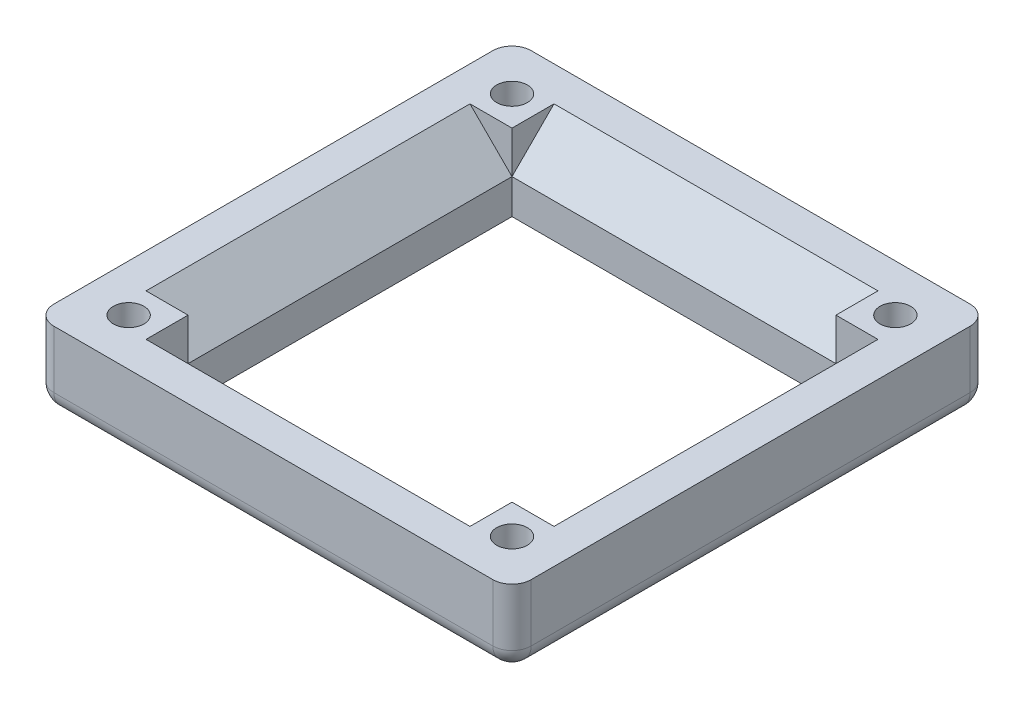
ISO-10303-21;
HEADER;
FILE_DESCRIPTION(('STEP AP214'),'2;1');
FILE_NAME('part.step','',(''),(''),'','','');
FILE_SCHEMA(('AUTOMOTIVE_DESIGN { 1 0 10303 214 1 1 1 1 }'));
ENDSEC;
DATA;
#1=APPLICATION_CONTEXT('core data for automotive mechanical design processes');
#2=APPLICATION_PROTOCOL_DEFINITION('international standard','automotive_design',2000,#1);
#3=PRODUCT_CONTEXT('',#1,'mechanical');
#4=PRODUCT('Part','Part','',(#3));
#5=PRODUCT_RELATED_PRODUCT_CATEGORY('part','',(#4));
#6=PRODUCT_DEFINITION_FORMATION('','',#4);
#7=PRODUCT_DEFINITION_CONTEXT('part definition',#1,'design');
#8=PRODUCT_DEFINITION('design','',#6,#7);
#9=PRODUCT_DEFINITION_SHAPE('','',#8);
#10=(LENGTH_UNIT() NAMED_UNIT(*) SI_UNIT(.MILLI.,.METRE.));
#11=(NAMED_UNIT(*) PLANE_ANGLE_UNIT() SI_UNIT($,.RADIAN.));
#12=(NAMED_UNIT(*) SI_UNIT($,.STERADIAN.) SOLID_ANGLE_UNIT());
#13=UNCERTAINTY_MEASURE_WITH_UNIT(LENGTH_MEASURE(1.E-05),#10,'distance_accuracy_value','');
#14=(GEOMETRIC_REPRESENTATION_CONTEXT(3) GLOBAL_UNCERTAINTY_ASSIGNED_CONTEXT((#13)) GLOBAL_UNIT_ASSIGNED_CONTEXT((#10,
#11,#12)) REPRESENTATION_CONTEXT('',''));
#15=CARTESIAN_POINT('',(0.,0.,0.));
#16=DIRECTION('',(0.,0.,1.));
#17=DIRECTION('',(1.,0.,0.));
#18=AXIS2_PLACEMENT_3D('',#15,#16,#17);
#19=CARTESIAN_POINT('',(0.,0.,0.));
#20=DIRECTION('',(0.,-1.,0.));
#21=DIRECTION('',(0.,0.,-1.));
#22=AXIS2_PLACEMENT_3D('',#19,#20,#21);
#23=PLANE('',#22);
#24=CARTESIAN_POINT('',(-20.,0.,-20.));
#25=DIRECTION('',(0.,-1.,0.));
#26=DIRECTION('',(0.,0.,-1.));
#27=AXIS2_PLACEMENT_3D('',#24,#25,#26);
#28=CIRCLE('',#27,3.);
#29=CARTESIAN_POINT('',(-19.2318854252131,0.,-22.9));
#30=VERTEX_POINT('',#29);
#31=CARTESIAN_POINT('',(-22.9,0.,-19.2318854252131));
#32=VERTEX_POINT('',#31);
#33=EDGE_CURVE('E232',#30,#32,#28,.T.);
#34=ORIENTED_EDGE('',*,*,#33,.F.);
#35=DIRECTION('',(-1.,0.,0.));
#36=VECTOR('',#35,1.);
#37=CARTESIAN_POINT('',(24.9,0.,-22.9));
#38=LINE('',#37,#36);
#39=CARTESIAN_POINT('',(19.2318854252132,0.,-22.9));
#40=VERTEX_POINT('',#39);
#41=EDGE_CURVE('E249',#30,#40,#38,.F.);
#42=ORIENTED_EDGE('',*,*,#41,.T.);
#43=CARTESIAN_POINT('',(20.,0.,-20.));
#44=DIRECTION('',(0.,-1.,0.));
#45=DIRECTION('',(0.,0.,-1.));
#46=AXIS2_PLACEMENT_3D('',#43,#44,#45);
#47=CIRCLE('',#46,3.);
#48=CARTESIAN_POINT('',(22.9,0.,-19.2318854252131));
#49=VERTEX_POINT('',#48);
#50=EDGE_CURVE('E568',#49,#40,#47,.T.);
#51=ORIENTED_EDGE('',*,*,#50,.F.);
#52=DIRECTION('',(0.,0.,-1.));
#53=VECTOR('',#52,1.);
#54=CARTESIAN_POINT('',(22.9,0.,24.9));
#55=LINE('',#54,#53);
#56=CARTESIAN_POINT('',(22.9,0.,19.2318854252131));
#57=VERTEX_POINT('',#56);
#58=EDGE_CURVE('E327',#49,#57,#55,.F.);
#59=ORIENTED_EDGE('',*,*,#58,.T.);
#60=CARTESIAN_POINT('',(20.,0.,20.));
#61=DIRECTION('',(0.,-1.,0.));
#62=DIRECTION('',(0.,0.,-1.));
#63=AXIS2_PLACEMENT_3D('',#60,#61,#62);
#64=CIRCLE('',#63,3.);
#65=CARTESIAN_POINT('',(19.2318854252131,0.,22.9));
#66=VERTEX_POINT('',#65);
#67=EDGE_CURVE('E58',#66,#57,#64,.T.);
#68=ORIENTED_EDGE('',*,*,#67,.F.);
#69=DIRECTION('',(1.,0.,0.));
#70=VECTOR('',#69,1.);
#71=CARTESIAN_POINT('',(-24.9,0.,22.9));
#72=LINE('',#71,#70);
#73=CARTESIAN_POINT('',(-19.2318854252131,0.,22.9));
#74=VERTEX_POINT('',#73);
#75=EDGE_CURVE('E367',#66,#74,#72,.F.);
#76=ORIENTED_EDGE('',*,*,#75,.T.);
#77=CARTESIAN_POINT('',(-20.,0.,20.));
#78=DIRECTION('',(0.,-1.,0.));
#79=DIRECTION('',(0.,0.,-1.));
#80=AXIS2_PLACEMENT_3D('',#77,#78,#79);
#81=CIRCLE('',#80,3.);
#82=CARTESIAN_POINT('',(-22.9,0.,19.2318854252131));
#83=VERTEX_POINT('',#82);
#84=EDGE_CURVE('E625',#83,#74,#81,.T.);
#85=ORIENTED_EDGE('',*,*,#84,.F.);
#86=DIRECTION('',(0.,0.,1.));
#87=VECTOR('',#86,1.);
#88=CARTESIAN_POINT('',(-22.9,0.,-24.9));
#89=LINE('',#88,#87);
#90=EDGE_CURVE('E252',#83,#32,#89,.F.);
#91=ORIENTED_EDGE('',*,*,#90,.T.);
#92=EDGE_LOOP('',(#34,#42,#51,#59,#68,#76,#85,#91));
#93=FACE_BOUND('',#92,.T.);
#94=DIRECTION('',(1.,0.,0.));
#95=VECTOR('',#94,1.);
#96=CARTESIAN_POINT('',(0.,0.,-16.9));
#97=LINE('',#96,#95);
#98=CARTESIAN_POINT('',(-16.9,0.,-16.9));
#99=VERTEX_POINT('',#98);
#100=CARTESIAN_POINT('',(16.9,0.,-16.9));
#101=VERTEX_POINT('',#100);
#102=EDGE_CURVE('E717',#99,#101,#97,.T.);
#103=ORIENTED_EDGE('',*,*,#102,.F.);
#104=DIRECTION('',(0.,0.,-1.));
#105=VECTOR('',#104,1.);
#106=CARTESIAN_POINT('',(-16.9,0.,0.));
#107=LINE('',#106,#105);
#108=CARTESIAN_POINT('',(-16.9,0.,16.9));
#109=VERTEX_POINT('',#108);
#110=EDGE_CURVE('E714',#109,#99,#107,.T.);
#111=ORIENTED_EDGE('',*,*,#110,.F.);
#112=DIRECTION('',(1.,0.,0.));
#113=VECTOR('',#112,1.);
#114=CARTESIAN_POINT('',(0.,0.,16.9));
#115=LINE('',#114,#113);
#116=CARTESIAN_POINT('',(16.9,0.,16.9));
#117=VERTEX_POINT('',#116);
#118=EDGE_CURVE('E711',#109,#117,#115,.T.);
#119=ORIENTED_EDGE('',*,*,#118,.T.);
#120=DIRECTION('',(0.,0.,-1.));
#121=VECTOR('',#120,1.);
#122=CARTESIAN_POINT('',(16.9,0.,0.));
#123=LINE('',#122,#121);
#124=EDGE_CURVE('E708',#117,#101,#123,.T.);
#125=ORIENTED_EDGE('',*,*,#124,.T.);
#126=EDGE_LOOP('',(#103,#111,#119,#125));
#127=FACE_BOUND('',#126,.T.);
#128=ADVANCED_FACE('F42',(#93,#127),#23,.T.);
#129=CARTESIAN_POINT('',(20.7681145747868,0.,-22.9));
#130=VERTEX_POINT('',#129);
#131=CARTESIAN_POINT('',(22.9,0.,-20.7681145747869));
#132=VERTEX_POINT('',#131);
#133=EDGE_CURVE('E562',#130,#132,#47,.T.);
#134=ORIENTED_EDGE('',*,*,#133,.F.);
#135=CARTESIAN_POINT('',(22.9,0.,-22.9));
#136=VERTEX_POINT('',#135);
#137=EDGE_CURVE('E260',#130,#136,#38,.F.);
#138=ORIENTED_EDGE('',*,*,#137,.T.);
#139=EDGE_CURVE('E264',#136,#132,#55,.F.);
#140=ORIENTED_EDGE('',*,*,#139,.T.);
#141=EDGE_LOOP('',(#134,#138,#140));
#142=FACE_BOUND('',#141,.T.);
#143=ADVANCED_FACE('F781',(#142),#23,.T.);
#144=CARTESIAN_POINT('',(22.9,0.,20.7681145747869));
#145=VERTEX_POINT('',#144);
#146=CARTESIAN_POINT('',(20.7681145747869,0.,22.9));
#147=VERTEX_POINT('',#146);
#148=EDGE_CURVE('E554',#145,#147,#64,.T.);
#149=ORIENTED_EDGE('',*,*,#148,.F.);
#150=CARTESIAN_POINT('',(22.9,0.,22.9));
#151=VERTEX_POINT('',#150);
#152=EDGE_CURVE('E735',#145,#151,#55,.F.);
#153=ORIENTED_EDGE('',*,*,#152,.T.);
#154=EDGE_CURVE('E46',#151,#147,#72,.F.);
#155=ORIENTED_EDGE('',*,*,#154,.T.);
#156=EDGE_LOOP('',(#149,#153,#155));
#157=FACE_BOUND('',#156,.T.);
#158=ADVANCED_FACE('F740',(#157),#23,.T.);
#159=CARTESIAN_POINT('',(-20.7681145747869,0.,22.9));
#160=VERTEX_POINT('',#159);
#161=CARTESIAN_POINT('',(-22.9,0.,20.7681145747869));
#162=VERTEX_POINT('',#161);
#163=EDGE_CURVE('E66',#160,#162,#81,.T.);
#164=ORIENTED_EDGE('',*,*,#163,.F.);
#165=CARTESIAN_POINT('',(-22.9,0.,22.9));
#166=VERTEX_POINT('',#165);
#167=EDGE_CURVE('E374',#160,#166,#72,.F.);
#168=ORIENTED_EDGE('',*,*,#167,.T.);
#169=EDGE_CURVE('E291',#166,#162,#89,.F.);
#170=ORIENTED_EDGE('',*,*,#169,.T.);
#171=EDGE_LOOP('',(#164,#168,#170));
#172=FACE_BOUND('',#171,.T.);
#173=ADVANCED_FACE('F753',(#172),#23,.T.);
#174=CARTESIAN_POINT('',(-20.,8.00000000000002,20.));
#175=DIRECTION('',(0.,-1.,0.));
#176=DIRECTION('',(0.,0.,-1.));
#177=AXIS2_PLACEMENT_3D('',#174,#175,#176);
#178=CYLINDRICAL_SURFACE('',#177,1.6);
#179=CARTESIAN_POINT('',(-20.,8.00000000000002,20.));
#180=DIRECTION('',(0.,-1.,0.));
#181=DIRECTION('',(0.,0.,-1.));
#182=AXIS2_PLACEMENT_3D('',#179,#180,#181);
#183=CIRCLE('',#182,1.6);
#184=CARTESIAN_POINT('',(-20.,8.00000000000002,18.4));
#185=VERTEX_POINT('',#184);
#186=EDGE_CURVE('E482',#185,#185,#183,.T.);
#187=ORIENTED_EDGE('',*,*,#186,.F.);
#188=EDGE_LOOP('',(#187));
#189=FACE_BOUND('',#188,.T.);
#190=CARTESIAN_POINT('',(-20.,2.5,20.));
#191=DIRECTION('',(0.,-1.,0.));
#192=DIRECTION('',(0.,0.,-1.));
#193=AXIS2_PLACEMENT_3D('',#190,#191,#192);
#194=CIRCLE('',#193,1.6);
#195=CARTESIAN_POINT('',(-20.,2.5,18.4));
#196=VERTEX_POINT('',#195);
#197=EDGE_CURVE('E728',#196,#196,#194,.F.);
#198=ORIENTED_EDGE('',*,*,#197,.F.);
#199=EDGE_LOOP('',(#198));
#200=FACE_BOUND('',#199,.T.);
#201=ADVANCED_FACE('F814',(#189,#200),#178,.F.);
#202=CARTESIAN_POINT('',(20.,8.00000000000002,20.));
#203=DIRECTION('',(0.,-1.,0.));
#204=DIRECTION('',(0.,0.,-1.));
#205=AXIS2_PLACEMENT_3D('',#202,#203,#204);
#206=CYLINDRICAL_SURFACE('',#205,1.6);
#207=CARTESIAN_POINT('',(20.,8.00000000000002,20.));
#208=DIRECTION('',(0.,-1.,0.));
#209=DIRECTION('',(0.,0.,-1.));
#210=AXIS2_PLACEMENT_3D('',#207,#208,#209);
#211=CIRCLE('',#210,1.6);
#212=CARTESIAN_POINT('',(20.,8.00000000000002,18.4));
#213=VERTEX_POINT('',#212);
#214=EDGE_CURVE('E513',#213,#213,#211,.T.);
#215=ORIENTED_EDGE('',*,*,#214,.F.);
#216=EDGE_LOOP('',(#215));
#217=FACE_BOUND('',#216,.T.);
#218=CARTESIAN_POINT('',(20.,2.5,20.));
#219=DIRECTION('',(0.,-1.,0.));
#220=DIRECTION('',(0.,0.,-1.));
#221=AXIS2_PLACEMENT_3D('',#218,#219,#220);
#222=CIRCLE('',#221,1.6);
#223=CARTESIAN_POINT('',(20.,2.5,18.4));
#224=VERTEX_POINT('',#223);
#225=EDGE_CURVE('E725',#224,#224,#222,.F.);
#226=ORIENTED_EDGE('',*,*,#225,.F.);
#227=EDGE_LOOP('',(#226));
#228=FACE_BOUND('',#227,.T.);
#229=ADVANCED_FACE('F610',(#217,#228),#206,.F.);
#230=CARTESIAN_POINT('',(20.,8.00000000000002,-20.));
#231=DIRECTION('',(0.,-1.,0.));
#232=DIRECTION('',(0.,0.,-1.));
#233=AXIS2_PLACEMENT_3D('',#230,#231,#232);
#234=CYLINDRICAL_SURFACE('',#233,1.6);
#235=CARTESIAN_POINT('',(20.,8.00000000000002,-20.));
#236=DIRECTION('',(0.,-1.,0.));
#237=DIRECTION('',(0.,0.,-1.));
#238=AXIS2_PLACEMENT_3D('',#235,#236,#237);
#239=CIRCLE('',#238,1.6);
#240=CARTESIAN_POINT('',(20.,8.00000000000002,-21.6));
#241=VERTEX_POINT('',#240);
#242=EDGE_CURVE('E517',#241,#241,#239,.T.);
#243=ORIENTED_EDGE('',*,*,#242,.F.);
#244=EDGE_LOOP('',(#243));
#245=FACE_BOUND('',#244,.T.);
#246=CARTESIAN_POINT('',(20.,2.5,-20.));
#247=DIRECTION('',(0.,-1.,0.));
#248=DIRECTION('',(0.,0.,-1.));
#249=AXIS2_PLACEMENT_3D('',#246,#247,#248);
#250=CIRCLE('',#249,1.6);
#251=CARTESIAN_POINT('',(20.,2.5,-21.6));
#252=VERTEX_POINT('',#251);
#253=EDGE_CURVE('E722',#252,#252,#250,.F.);
#254=ORIENTED_EDGE('',*,*,#253,.F.);
#255=EDGE_LOOP('',(#254));
#256=FACE_BOUND('',#255,.T.);
#257=ADVANCED_FACE('F1264',(#245,#256),#234,.F.);
#258=CARTESIAN_POINT('',(-20.,8.00000000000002,-20.));
#259=DIRECTION('',(0.,-1.,0.));
#260=DIRECTION('',(0.,0.,-1.));
#261=AXIS2_PLACEMENT_3D('',#258,#259,#260);
#262=CYLINDRICAL_SURFACE('',#261,1.6);
#263=CARTESIAN_POINT('',(-20.,8.00000000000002,-20.));
#264=DIRECTION('',(0.,-1.,0.));
#265=DIRECTION('',(0.,0.,-1.));
#266=AXIS2_PLACEMENT_3D('',#263,#264,#265);
#267=CIRCLE('',#266,1.6);
#268=CARTESIAN_POINT('',(-20.,8.00000000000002,-21.6));
#269=VERTEX_POINT('',#268);
#270=EDGE_CURVE('E514',#269,#269,#267,.T.);
#271=ORIENTED_EDGE('',*,*,#270,.F.);
#272=EDGE_LOOP('',(#271));
#273=FACE_BOUND('',#272,.T.);
#274=CARTESIAN_POINT('',(-20.,2.5,-20.));
#275=DIRECTION('',(0.,-1.,0.));
#276=DIRECTION('',(0.,0.,-1.));
#277=AXIS2_PLACEMENT_3D('',#274,#275,#276);
#278=CIRCLE('',#277,1.6);
#279=CARTESIAN_POINT('',(-20.,2.5,-21.6));
#280=VERTEX_POINT('',#279);
#281=EDGE_CURVE('E632',#280,#280,#278,.F.);
#282=ORIENTED_EDGE('',*,*,#281,.F.);
#283=EDGE_LOOP('',(#282));
#284=FACE_BOUND('',#283,.T.);
#285=ADVANCED_FACE('F1157',(#273,#284),#262,.F.);
#286=CARTESIAN_POINT('',(0.,8.,0.));
#287=DIRECTION('',(0.,-1.,0.));
#288=DIRECTION('',(0.,0.,-1.));
#289=AXIS2_PLACEMENT_3D('',#286,#287,#288);
#290=PLANE('',#289);
#291=ORIENTED_EDGE('',*,*,#270,.T.);
#292=EDGE_LOOP('',(#291));
#293=FACE_BOUND('',#292,.T.);
#294=ORIENTED_EDGE('',*,*,#242,.T.);
#295=EDGE_LOOP('',(#294));
#296=FACE_BOUND('',#295,.T.);
#297=ORIENTED_EDGE('',*,*,#214,.T.);
#298=EDGE_LOOP('',(#297));
#299=FACE_BOUND('',#298,.T.);
#300=ORIENTED_EDGE('',*,*,#186,.T.);
#301=EDGE_LOOP('',(#300));
#302=FACE_BOUND('',#301,.T.);
#303=DIRECTION('',(-1.,0.,0.));
#304=VECTOR('',#303,1.);
#305=CARTESIAN_POINT('',(24.9,8.,-24.9));
#306=LINE('',#305,#304);
#307=CARTESIAN_POINT('',(22.9,8.,-24.9));
#308=VERTEX_POINT('',#307);
#309=CARTESIAN_POINT('',(-22.9,8.,-24.9));
#310=VERTEX_POINT('',#309);
#311=EDGE_CURVE('E413',#308,#310,#306,.T.);
#312=ORIENTED_EDGE('',*,*,#311,.T.);
#313=CARTESIAN_POINT('',(-22.9,8.,-22.9));
#314=DIRECTION('',(0.,-1.,0.));
#315=DIRECTION('',(0.,0.,-1.));
#316=AXIS2_PLACEMENT_3D('',#313,#314,#315);
#317=CIRCLE('',#316,2.);
#318=CARTESIAN_POINT('',(-24.9,8.,-22.9));
#319=VERTEX_POINT('',#318);
#320=EDGE_CURVE('E392',#310,#319,#317,.F.);
#321=ORIENTED_EDGE('',*,*,#320,.T.);
#322=DIRECTION('',(0.,0.,1.));
#323=VECTOR('',#322,1.);
#324=CARTESIAN_POINT('',(-24.9,8.,-24.9));
#325=LINE('',#324,#323);
#326=CARTESIAN_POINT('',(-24.9,8.,22.9));
#327=VERTEX_POINT('',#326);
#328=EDGE_CURVE('E422',#319,#327,#325,.T.);
#329=ORIENTED_EDGE('',*,*,#328,.T.);
#330=CARTESIAN_POINT('',(-22.9,8.,22.9));
#331=DIRECTION('',(0.,-1.,0.));
#332=DIRECTION('',(0.,0.,-1.));
#333=AXIS2_PLACEMENT_3D('',#330,#331,#332);
#334=CIRCLE('',#333,2.);
#335=CARTESIAN_POINT('',(-22.9,8.,24.9));
#336=VERTEX_POINT('',#335);
#337=EDGE_CURVE('E398',#327,#336,#334,.F.);
#338=ORIENTED_EDGE('',*,*,#337,.T.);
#339=DIRECTION('',(1.,0.,0.));
#340=VECTOR('',#339,1.);
#341=CARTESIAN_POINT('',(24.9,8.,24.9));
#342=LINE('',#341,#340);
#343=CARTESIAN_POINT('',(22.9,8.,24.9));
#344=VERTEX_POINT('',#343);
#345=EDGE_CURVE('E419',#336,#344,#342,.T.);
#346=ORIENTED_EDGE('',*,*,#345,.T.);
#347=CARTESIAN_POINT('',(22.9,8.,22.9));
#348=DIRECTION('',(0.,-1.,0.));
#349=DIRECTION('',(0.,0.,-1.));
#350=AXIS2_PLACEMENT_3D('',#347,#348,#349);
#351=CIRCLE('',#350,2.);
#352=CARTESIAN_POINT('',(24.9,8.,22.9));
#353=VERTEX_POINT('',#352);
#354=EDGE_CURVE('E396',#344,#353,#351,.F.);
#355=ORIENTED_EDGE('',*,*,#354,.T.);
#356=DIRECTION('',(0.,0.,-1.));
#357=VECTOR('',#356,1.);
#358=CARTESIAN_POINT('',(24.9,8.,-24.9));
#359=LINE('',#358,#357);
#360=CARTESIAN_POINT('',(24.9,8.,-22.9));
#361=VERTEX_POINT('',#360);
#362=EDGE_CURVE('E416',#353,#361,#359,.T.);
#363=ORIENTED_EDGE('',*,*,#362,.T.);
#364=CARTESIAN_POINT('',(22.9,8.,-22.9));
#365=DIRECTION('',(0.,-1.,0.));
#366=DIRECTION('',(0.,0.,-1.));
#367=AXIS2_PLACEMENT_3D('',#364,#365,#366);
#368=CIRCLE('',#367,2.);
#369=EDGE_CURVE('E394',#361,#308,#368,.F.);
#370=ORIENTED_EDGE('',*,*,#369,.T.);
#371=EDGE_LOOP('',(#312,#321,#329,#338,#346,#355,#363,#370));
#372=FACE_BOUND('',#371,.T.);
#373=DIRECTION('',(1.,0.,0.));
#374=VECTOR('',#373,1.);
#375=CARTESIAN_POINT('',(-23.1,8.,-21.2840620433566));
#376=LINE('',#375,#374);
#377=CARTESIAN_POINT('',(-16.9,8.,-21.2840620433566));
#378=VERTEX_POINT('',#377);
#379=CARTESIAN_POINT('',(16.9,8.,-21.2840620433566));
#380=VERTEX_POINT('',#379);
#381=EDGE_CURVE('E495',#378,#380,#376,.T.);
#382=ORIENTED_EDGE('',*,*,#381,.T.);
#383=DIRECTION('',(0.,0.,-1.));
#384=VECTOR('',#383,1.);
#385=CARTESIAN_POINT('',(16.9,8.,-21.2840620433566));
#386=LINE('',#385,#384);
#387=CARTESIAN_POINT('',(16.9,8.00000000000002,-16.9));
#388=VERTEX_POINT('',#387);
#389=EDGE_CURVE('E490',#388,#380,#386,.T.);
#390=ORIENTED_EDGE('',*,*,#389,.F.);
#391=DIRECTION('',(1.,0.,0.));
#392=VECTOR('',#391,1.);
#393=CARTESIAN_POINT('',(-16.9,8.,-16.9));
#394=LINE('',#393,#392);
#395=CARTESIAN_POINT('',(21.2840620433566,8.00000000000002,-16.9));
#396=VERTEX_POINT('',#395);
#397=EDGE_CURVE('E442',#388,#396,#394,.T.);
#398=ORIENTED_EDGE('',*,*,#397,.T.);
#399=DIRECTION('',(0.,0.,-1.));
#400=VECTOR('',#399,1.);
#401=CARTESIAN_POINT('',(21.2840620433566,8.00000000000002,23.1));
#402=LINE('',#401,#400);
#403=CARTESIAN_POINT('',(21.2840620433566,8.00000000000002,16.9));
#404=VERTEX_POINT('',#403);
#405=EDGE_CURVE('E446',#404,#396,#402,.T.);
#406=ORIENTED_EDGE('',*,*,#405,.F.);
#407=DIRECTION('',(1.,0.,0.));
#408=VECTOR('',#407,1.);
#409=CARTESIAN_POINT('',(-16.9,8.,16.9));
#410=LINE('',#409,#408);
#411=CARTESIAN_POINT('',(16.9,8.00000000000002,16.9));
#412=VERTEX_POINT('',#411);
#413=EDGE_CURVE('E438',#412,#404,#410,.T.);
#414=ORIENTED_EDGE('',*,*,#413,.F.);
#415=DIRECTION('',(0.,0.,-1.));
#416=VECTOR('',#415,1.);
#417=CARTESIAN_POINT('',(16.9,8.,21.2840620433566));
#418=LINE('',#417,#416);
#419=CARTESIAN_POINT('',(16.9,8.,21.2840620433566));
#420=VERTEX_POINT('',#419);
#421=EDGE_CURVE('E470',#420,#412,#418,.T.);
#422=ORIENTED_EDGE('',*,*,#421,.F.);
#423=DIRECTION('',(1.,0.,0.));
#424=VECTOR('',#423,1.);
#425=CARTESIAN_POINT('',(-23.1,8.,21.2840620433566));
#426=LINE('',#425,#424);
#427=CARTESIAN_POINT('',(-16.9,8.,21.2840620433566));
#428=VERTEX_POINT('',#427);
#429=EDGE_CURVE('E473',#428,#420,#426,.T.);
#430=ORIENTED_EDGE('',*,*,#429,.F.);
#431=DIRECTION('',(0.,0.,-1.));
#432=VECTOR('',#431,1.);
#433=CARTESIAN_POINT('',(-16.9,8.,21.2840620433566));
#434=LINE('',#433,#432);
#435=CARTESIAN_POINT('',(-16.9,8.00000000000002,16.9));
#436=VERTEX_POINT('',#435);
#437=EDGE_CURVE('E478',#428,#436,#434,.T.);
#438=ORIENTED_EDGE('',*,*,#437,.T.);
#439=CARTESIAN_POINT('',(-21.2840620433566,8.,16.9));
#440=VERTEX_POINT('',#439);
#441=EDGE_CURVE('E429',#440,#436,#410,.T.);
#442=ORIENTED_EDGE('',*,*,#441,.F.);
#443=DIRECTION('',(0.,0.,-1.));
#444=VECTOR('',#443,1.);
#445=CARTESIAN_POINT('',(-21.2840620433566,8.,23.1));
#446=LINE('',#445,#444);
#447=CARTESIAN_POINT('',(-21.2840620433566,8.,-16.9));
#448=VERTEX_POINT('',#447);
#449=EDGE_CURVE('E457',#440,#448,#446,.T.);
#450=ORIENTED_EDGE('',*,*,#449,.T.);
#451=CARTESIAN_POINT('',(-16.9,8.,-16.9));
#452=VERTEX_POINT('',#451);
#453=EDGE_CURVE('E439',#448,#452,#394,.T.);
#454=ORIENTED_EDGE('',*,*,#453,.T.);
#455=DIRECTION('',(0.,0.,-1.));
#456=VECTOR('',#455,1.);
#457=CARTESIAN_POINT('',(-16.9,8.,-21.2840620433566));
#458=LINE('',#457,#456);
#459=EDGE_CURVE('E501',#452,#378,#458,.T.);
#460=ORIENTED_EDGE('',*,*,#459,.T.);
#461=EDGE_LOOP('',(#382,#390,#398,#406,#414,#422,#430,#438,#442,#450,#454,#460));
#462=FACE_BOUND('',#461,.T.);
#463=ADVANCED_FACE('F768',(#293,#296,#299,#302,#372,#462),#290,.F.);
#464=CARTESIAN_POINT('',(-16.9,8.,-16.9));
#465=DIRECTION('',(0.,0.,-1.));
#466=DIRECTION('',(-1.,0.,0.));
#467=AXIS2_PLACEMENT_3D('',#464,#465,#466);
#468=PLANE('',#467);
#469=DIRECTION('',(1.,0.,0.));
#470=VECTOR('',#469,1.);
#471=CARTESIAN_POINT('',(-23.1,3.61593795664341,-16.9));
#472=LINE('',#471,#470);
#473=CARTESIAN_POINT('',(-16.9,3.61593795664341,-16.9));
#474=VERTEX_POINT('',#473);
#475=CARTESIAN_POINT('',(16.9,3.61593795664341,-16.9));
#476=VERTEX_POINT('',#475);
#477=EDGE_CURVE('E491',#474,#476,#472,.T.);
#478=ORIENTED_EDGE('',*,*,#477,.F.);
#479=DIRECTION('',(0.,-1.,0.));
#480=VECTOR('',#479,1.);
#481=CARTESIAN_POINT('',(-16.9,8.,-16.9));
#482=LINE('',#481,#480);
#483=EDGE_CURVE('E433',#474,#99,#482,.T.);
#484=ORIENTED_EDGE('',*,*,#483,.T.);
#485=ORIENTED_EDGE('',*,*,#102,.T.);
#486=DIRECTION('',(0.,-1.,0.));
#487=VECTOR('',#486,1.);
#488=CARTESIAN_POINT('',(16.9,8.,-16.9));
#489=LINE('',#488,#487);
#490=EDGE_CURVE('E426',#476,#101,#489,.T.);
#491=ORIENTED_EDGE('',*,*,#490,.F.);
#492=EDGE_LOOP('',(#478,#484,#485,#491));
#493=FACE_BOUND('',#492,.T.);
#494=ADVANCED_FACE('F987',(#493),#468,.F.);
#495=ORIENTED_EDGE('',*,*,#397,.F.);
#496=DIRECTION('',(0.,1.,0.));
#497=VECTOR('',#496,1.);
#498=CARTESIAN_POINT('',(16.9,8.00000000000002,-16.9));
#499=LINE('',#498,#497);
#500=EDGE_CURVE('E493',#476,#388,#499,.T.);
#501=ORIENTED_EDGE('',*,*,#500,.F.);
#502=DIRECTION('',(0.707106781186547,0.707106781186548,0.));
#503=VECTOR('',#502,1.);
#504=CARTESIAN_POINT('',(16.9,3.61593795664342,-16.9));
#505=LINE('',#504,#503);
#506=EDGE_CURVE('E448',#476,#396,#505,.T.);
#507=ORIENTED_EDGE('',*,*,#506,.T.);
#508=EDGE_LOOP('',(#495,#501,#507));
#509=FACE_BOUND('',#508,.T.);
#510=ADVANCED_FACE('F992',(#509),#468,.F.);
#511=CARTESIAN_POINT('',(-16.9,8.,16.9));
#512=DIRECTION('',(0.,0.,-1.));
#513=DIRECTION('',(-1.,0.,0.));
#514=AXIS2_PLACEMENT_3D('',#511,#512,#513);
#515=PLANE('',#514);
#516=DIRECTION('',(-0.707106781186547,-0.707106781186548,0.));
#517=VECTOR('',#516,1.);
#518=CARTESIAN_POINT('',(16.9,3.61593795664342,16.9));
#519=LINE('',#518,#517);
#520=CARTESIAN_POINT('',(16.9,3.61593795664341,16.9));
#521=VERTEX_POINT('',#520);
#522=EDGE_CURVE('E443',#404,#521,#519,.T.);
#523=ORIENTED_EDGE('',*,*,#522,.T.);
#524=DIRECTION('',(0.,-1.,0.));
#525=VECTOR('',#524,1.);
#526=CARTESIAN_POINT('',(16.9,8.00000000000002,16.9));
#527=LINE('',#526,#525);
#528=EDGE_CURVE('E468',#412,#521,#527,.T.);
#529=ORIENTED_EDGE('',*,*,#528,.F.);
#530=ORIENTED_EDGE('',*,*,#413,.T.);
#531=EDGE_LOOP('',(#523,#529,#530));
#532=FACE_BOUND('',#531,.T.);
#533=ADVANCED_FACE('F1005',(#532),#515,.T.);
#534=DIRECTION('',(0.,-1.,0.));
#535=VECTOR('',#534,1.);
#536=CARTESIAN_POINT('',(-16.9,8.,16.9));
#537=LINE('',#536,#535);
#538=CARTESIAN_POINT('',(-16.9,3.61593795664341,16.9));
#539=VERTEX_POINT('',#538);
#540=EDGE_CURVE('E431',#539,#109,#537,.T.);
#541=ORIENTED_EDGE('',*,*,#540,.F.);
#542=DIRECTION('',(1.,0.,0.));
#543=VECTOR('',#542,1.);
#544=CARTESIAN_POINT('',(-23.1,3.61593795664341,16.9));
#545=LINE('',#544,#543);
#546=EDGE_CURVE('E477',#539,#521,#545,.T.);
#547=ORIENTED_EDGE('',*,*,#546,.T.);
#548=DIRECTION('',(0.,-1.,0.));
#549=VECTOR('',#548,1.);
#550=CARTESIAN_POINT('',(16.9,8.,16.9));
#551=LINE('',#550,#549);
#552=EDGE_CURVE('E428',#521,#117,#551,.T.);
#553=ORIENTED_EDGE('',*,*,#552,.T.);
#554=ORIENTED_EDGE('',*,*,#118,.F.);
#555=EDGE_LOOP('',(#541,#547,#553,#554));
#556=FACE_BOUND('',#555,.T.);
#557=ADVANCED_FACE('F1016',(#556),#515,.T.);
#558=CARTESIAN_POINT('',(-16.9,8.,16.9));
#559=DIRECTION('',(-1.,0.,0.));
#560=DIRECTION('',(0.,0.,1.));
#561=AXIS2_PLACEMENT_3D('',#558,#559,#560);
#562=PLANE('',#561);
#563=DIRECTION('',(0.,0.,-1.));
#564=VECTOR('',#563,1.);
#565=CARTESIAN_POINT('',(-16.9,3.61593795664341,23.1));
#566=LINE('',#565,#564);
#567=EDGE_CURVE('E461',#539,#474,#566,.T.);
#568=ORIENTED_EDGE('',*,*,#567,.F.);
#569=ORIENTED_EDGE('',*,*,#540,.T.);
#570=ORIENTED_EDGE('',*,*,#110,.T.);
#571=ORIENTED_EDGE('',*,*,#483,.F.);
#572=EDGE_LOOP('',(#568,#569,#570,#571));
#573=FACE_BOUND('',#572,.T.);
#574=ADVANCED_FACE('F1029',(#573),#562,.F.);
#575=CARTESIAN_POINT('',(16.9,8.,16.9));
#576=DIRECTION('',(-1.,0.,0.));
#577=DIRECTION('',(0.,0.,1.));
#578=AXIS2_PLACEMENT_3D('',#575,#576,#577);
#579=PLANE('',#578);
#580=ORIENTED_EDGE('',*,*,#552,.F.);
#581=DIRECTION('',(0.,0.,-1.));
#582=VECTOR('',#581,1.);
#583=CARTESIAN_POINT('',(16.9,3.61593795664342,23.1));
#584=LINE('',#583,#582);
#585=EDGE_CURVE('E452',#521,#476,#584,.T.);
#586=ORIENTED_EDGE('',*,*,#585,.T.);
#587=ORIENTED_EDGE('',*,*,#490,.T.);
#588=ORIENTED_EDGE('',*,*,#124,.F.);
#589=EDGE_LOOP('',(#580,#586,#587,#588));
#590=FACE_BOUND('',#589,.T.);
#591=ADVANCED_FACE('F1039',(#590),#579,.T.);
#592=CARTESIAN_POINT('',(-24.9,8.,-24.9));
#593=DIRECTION('',(1.,0.,0.));
#594=DIRECTION('',(0.,0.,-1.));
#595=AXIS2_PLACEMENT_3D('',#592,#593,#594);
#596=PLANE('',#595);
#597=ORIENTED_EDGE('',*,*,#328,.F.);
#598=DIRECTION('',(0.,-1.,0.));
#599=VECTOR('',#598,1.);
#600=CARTESIAN_POINT('',(-24.9,8.,-22.9));
#601=LINE('',#600,#599);
#602=CARTESIAN_POINT('',(-24.9,2.,-22.9));
#603=VERTEX_POINT('',#602);
#604=EDGE_CURVE('E406',#319,#603,#601,.T.);
#605=ORIENTED_EDGE('',*,*,#604,.T.);
#606=DIRECTION('',(0.,0.,1.));
#607=VECTOR('',#606,1.);
#608=CARTESIAN_POINT('',(-24.9,2.,24.9));
#609=LINE('',#608,#607);
#610=CARTESIAN_POINT('',(-24.9,2.,22.9));
#611=VERTEX_POINT('',#610);
#612=EDGE_CURVE('E411',#603,#611,#609,.T.);
#613=ORIENTED_EDGE('',*,*,#612,.T.);
#614=DIRECTION('',(0.,-1.,0.));
#615=VECTOR('',#614,1.);
#616=CARTESIAN_POINT('',(-24.9,8.,22.9));
#617=LINE('',#616,#615);
#618=EDGE_CURVE('E409',#611,#327,#617,.F.);
#619=ORIENTED_EDGE('',*,*,#618,.T.);
#620=EDGE_LOOP('',(#597,#605,#613,#619));
#621=FACE_BOUND('',#620,.T.);
#622=ADVANCED_FACE('F766',(#621),#596,.F.);
#623=CARTESIAN_POINT('',(24.9,8.,24.9));
#624=DIRECTION('',(0.,0.,-1.));
#625=DIRECTION('',(-1.,0.,0.));
#626=AXIS2_PLACEMENT_3D('',#623,#624,#625);
#627=PLANE('',#626);
#628=DIRECTION('',(1.,0.,0.));
#629=VECTOR('',#628,1.);
#630=CARTESIAN_POINT('',(24.9,2.,24.9));
#631=LINE('',#630,#629);
#632=CARTESIAN_POINT('',(-22.9,2.,24.9));
#633=VERTEX_POINT('',#632);
#634=CARTESIAN_POINT('',(22.9,2.,24.9));
#635=VERTEX_POINT('',#634);
#636=EDGE_CURVE('E384',#633,#635,#631,.T.);
#637=ORIENTED_EDGE('',*,*,#636,.T.);
#638=DIRECTION('',(0.,-1.,0.));
#639=VECTOR('',#638,1.);
#640=CARTESIAN_POINT('',(22.9,8.,24.9));
#641=LINE('',#640,#639);
#642=EDGE_CURVE('E378',#635,#344,#641,.F.);
#643=ORIENTED_EDGE('',*,*,#642,.T.);
#644=ORIENTED_EDGE('',*,*,#345,.F.);
#645=DIRECTION('',(0.,-1.,0.));
#646=VECTOR('',#645,1.);
#647=CARTESIAN_POINT('',(-22.9,8.,24.9));
#648=LINE('',#647,#646);
#649=EDGE_CURVE('E382',#336,#633,#648,.T.);
#650=ORIENTED_EDGE('',*,*,#649,.T.);
#651=EDGE_LOOP('',(#637,#643,#644,#650));
#652=FACE_BOUND('',#651,.T.);
#653=ADVANCED_FACE('F1221',(#652),#627,.F.);
#654=CARTESIAN_POINT('',(24.9,8.,-24.9));
#655=DIRECTION('',(-1.,0.,0.));
#656=DIRECTION('',(0.,0.,1.));
#657=AXIS2_PLACEMENT_3D('',#654,#655,#656);
#658=PLANE('',#657);
#659=DIRECTION('',(0.,0.,-1.));
#660=VECTOR('',#659,1.);
#661=CARTESIAN_POINT('',(24.9,2.,-24.9));
#662=LINE('',#661,#660);
#663=CARTESIAN_POINT('',(24.9,2.,22.9));
#664=VERTEX_POINT('',#663);
#665=CARTESIAN_POINT('',(24.9,2.,-22.9));
#666=VERTEX_POINT('',#665);
#667=EDGE_CURVE('E390',#664,#666,#662,.T.);
#668=ORIENTED_EDGE('',*,*,#667,.T.);
#669=DIRECTION('',(0.,-1.,0.));
#670=VECTOR('',#669,1.);
#671=CARTESIAN_POINT('',(24.9,8.,-22.9));
#672=LINE('',#671,#670);
#673=EDGE_CURVE('E386',#666,#361,#672,.F.);
#674=ORIENTED_EDGE('',*,*,#673,.T.);
#675=ORIENTED_EDGE('',*,*,#362,.F.);
#676=DIRECTION('',(0.,-1.,0.));
#677=VECTOR('',#676,1.);
#678=CARTESIAN_POINT('',(24.9,8.,22.9));
#679=LINE('',#678,#677);
#680=EDGE_CURVE('E388',#353,#664,#679,.T.);
#681=ORIENTED_EDGE('',*,*,#680,.T.);
#682=EDGE_LOOP('',(#668,#674,#675,#681));
#683=FACE_BOUND('',#682,.T.);
#684=ADVANCED_FACE('F785',(#683),#658,.F.);
#685=CARTESIAN_POINT('',(24.9,8.,-24.9));
#686=DIRECTION('',(0.,0.,1.));
#687=DIRECTION('',(1.,0.,0.));
#688=AXIS2_PLACEMENT_3D('',#685,#686,#687);
#689=PLANE('',#688);
#690=DIRECTION('',(-1.,0.,0.));
#691=VECTOR('',#690,1.);
#692=CARTESIAN_POINT('',(-24.9,2.,-24.9));
#693=LINE('',#692,#691);
#694=CARTESIAN_POINT('',(22.9,2.,-24.9));
#695=VERTEX_POINT('',#694);
#696=CARTESIAN_POINT('',(-22.9,2.,-24.9));
#697=VERTEX_POINT('',#696);
#698=EDGE_CURVE('E404',#695,#697,#693,.T.);
#699=ORIENTED_EDGE('',*,*,#698,.T.);
#700=DIRECTION('',(0.,-1.,0.));
#701=VECTOR('',#700,1.);
#702=CARTESIAN_POINT('',(-22.9,8.,-24.9));
#703=LINE('',#702,#701);
#704=EDGE_CURVE('E400',#697,#310,#703,.F.);
#705=ORIENTED_EDGE('',*,*,#704,.T.);
#706=ORIENTED_EDGE('',*,*,#311,.F.);
#707=DIRECTION('',(0.,-1.,0.));
#708=VECTOR('',#707,1.);
#709=CARTESIAN_POINT('',(22.9,8.,-24.9));
#710=LINE('',#709,#708);
#711=EDGE_CURVE('E402',#308,#695,#710,.T.);
#712=ORIENTED_EDGE('',*,*,#711,.T.);
#713=EDGE_LOOP('',(#699,#705,#706,#712));
#714=FACE_BOUND('',#713,.T.);
#715=ADVANCED_FACE('F773',(#714),#689,.F.);
#716=CARTESIAN_POINT('',(-22.9,0.,-20.7681145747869));
#717=VERTEX_POINT('',#716);
#718=CARTESIAN_POINT('',(-20.7681145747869,0.,-22.9));
#719=VERTEX_POINT('',#718);
#720=EDGE_CURVE('E235',#717,#719,#28,.T.);
#721=ORIENTED_EDGE('',*,*,#720,.F.);
#722=CARTESIAN_POINT('',(-22.9,0.,-22.9));
#723=VERTEX_POINT('',#722);
#724=EDGE_CURVE('E262',#717,#723,#89,.F.);
#725=ORIENTED_EDGE('',*,*,#724,.T.);
#726=EDGE_CURVE('E259',#723,#719,#38,.F.);
#727=ORIENTED_EDGE('',*,*,#726,.T.);
#728=EDGE_LOOP('',(#721,#725,#727));
#729=FACE_BOUND('',#728,.T.);
#730=ADVANCED_FACE('F660',(#729),#23,.T.);
#731=CARTESIAN_POINT('',(22.9,8.,22.9));
#732=DIRECTION('',(0.,-1.,0.));
#733=DIRECTION('',(0.,0.,-1.));
#734=AXIS2_PLACEMENT_3D('',#731,#732,#733);
#735=CYLINDRICAL_SURFACE('',#734,2.);
#736=CARTESIAN_POINT('',(22.9,2.,22.9));
#737=DIRECTION('',(0.,-1.,0.));
#738=DIRECTION('',(0.,0.,-1.));
#739=AXIS2_PLACEMENT_3D('',#736,#737,#738);
#740=CIRCLE('',#739,2.);
#741=EDGE_CURVE('E425',#664,#635,#740,.T.);
#742=ORIENTED_EDGE('',*,*,#741,.F.);
#743=ORIENTED_EDGE('',*,*,#680,.F.);
#744=ORIENTED_EDGE('',*,*,#354,.F.);
#745=ORIENTED_EDGE('',*,*,#642,.F.);
#746=EDGE_LOOP('',(#742,#743,#744,#745));
#747=FACE_BOUND('',#746,.T.);
#748=ADVANCED_FACE('F44',(#747),#735,.T.);
#749=CARTESIAN_POINT('',(22.9,2.,22.9));
#750=DIRECTION('',(0.,0.,1.));
#751=DIRECTION('',(1.,0.,0.));
#752=AXIS2_PLACEMENT_3D('',#749,#750,#751);
#753=SPHERICAL_SURFACE('',#752,2.);
#754=CARTESIAN_POINT('',(22.9,2.,22.9));
#755=DIRECTION('',(0.,0.,1.));
#756=DIRECTION('',(1.,0.,0.));
#757=AXIS2_PLACEMENT_3D('',#754,#755,#756);
#758=CIRCLE('',#757,2.);
#759=EDGE_CURVE('E700',#664,#151,#758,.F.);
#760=ORIENTED_EDGE('',*,*,#759,.F.);
#761=ORIENTED_EDGE('',*,*,#741,.T.);
#762=CARTESIAN_POINT('',(22.9,2.,22.9));
#763=DIRECTION('',(1.,0.,0.));
#764=DIRECTION('',(0.,0.,-1.));
#765=AXIS2_PLACEMENT_3D('',#762,#763,#764);
#766=CIRCLE('',#765,2.);
#767=EDGE_CURVE('E703',#151,#635,#766,.F.);
#768=ORIENTED_EDGE('',*,*,#767,.F.);
#769=EDGE_LOOP('',(#760,#761,#768));
#770=FACE_BOUND('',#769,.T.);
#771=ADVANCED_FACE('F793',(#770),#753,.T.);
#772=CARTESIAN_POINT('',(-22.9,8.,22.9));
#773=DIRECTION('',(0.,-1.,0.));
#774=DIRECTION('',(0.,0.,-1.));
#775=AXIS2_PLACEMENT_3D('',#772,#773,#774);
#776=CYLINDRICAL_SURFACE('',#775,2.);
#777=ORIENTED_EDGE('',*,*,#337,.F.);
#778=ORIENTED_EDGE('',*,*,#618,.F.);
#779=CARTESIAN_POINT('',(-22.9,2.,22.9));
#780=DIRECTION('',(0.,-1.,0.));
#781=DIRECTION('',(0.,0.,-1.));
#782=AXIS2_PLACEMENT_3D('',#779,#780,#781);
#783=CIRCLE('',#782,2.);
#784=EDGE_CURVE('E697',#633,#611,#783,.T.);
#785=ORIENTED_EDGE('',*,*,#784,.F.);
#786=ORIENTED_EDGE('',*,*,#649,.F.);
#787=EDGE_LOOP('',(#777,#778,#785,#786));
#788=FACE_BOUND('',#787,.T.);
#789=ADVANCED_FACE('F763',(#788),#776,.T.);
#790=CARTESIAN_POINT('',(24.9,2.,22.9));
#791=DIRECTION('',(-1.,0.,0.));
#792=DIRECTION('',(0.,0.,1.));
#793=AXIS2_PLACEMENT_3D('',#790,#791,#792);
#794=CYLINDRICAL_SURFACE('',#793,2.);
#795=CARTESIAN_POINT('',(20.7681145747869,0.,22.9));
#796=CARTESIAN_POINT('',(20.7265505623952,-7.24135800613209E-07,22.9110095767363));
#797=CARTESIAN_POINT('',(20.6847495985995,2.27999818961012E-05,22.9211243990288));
#798=CARTESIAN_POINT('',(20.6007516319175,0.00011617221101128,22.9395484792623));
#799=CARTESIAN_POINT('',(20.5585546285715,0.000186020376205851,22.9478577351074));
#800=CARTESIAN_POINT('',(20.4738424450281,0.00036986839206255,22.9626546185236));
#801=CARTESIAN_POINT('',(20.4313272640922,0.00048386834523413,22.9691422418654));
#802=CARTESIAN_POINT('',(20.3460572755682,0.000766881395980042,22.9802840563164));
#803=CARTESIAN_POINT('',(20.303302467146,0.000935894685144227,22.9849382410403));
#804=CARTESIAN_POINT('',(20.2176325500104,0.00128766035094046,22.9924045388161));
#805=CARTESIAN_POINT('',(20.1747174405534,0.00147041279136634,22.9952166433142));
#806=CARTESIAN_POINT('',(20.0888051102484,0.00200389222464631,22.9989935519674));
#807=CARTESIAN_POINT('',(20.0458078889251,0.00235462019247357,22.9999583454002));
#808=CARTESIAN_POINT('',(19.9780079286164,0.00258622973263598,23.0000219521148));
#809=CARTESIAN_POINT('',(19.9532045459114,0.00260312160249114,22.9997375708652));
#810=CARTESIAN_POINT('',(19.8851423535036,0.00254393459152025,22.9981128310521));
#811=CARTESIAN_POINT('',(19.8418973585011,0.00238923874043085,22.996143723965));
#812=CARTESIAN_POINT('',(19.7370987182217,0.00197374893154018,22.9890961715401));
#813=CARTESIAN_POINT('',(19.6756082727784,0.00169585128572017,22.9830493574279));
#814=CARTESIAN_POINT('',(19.5571277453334,0.00114461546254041,22.9676919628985));
#815=CARTESIAN_POINT('',(19.5001064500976,0.000872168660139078,22.9586208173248));
#816=CARTESIAN_POINT('',(19.4008077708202,0.000443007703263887,22.9398719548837));
#817=CARTESIAN_POINT('',(19.3583947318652,0.000274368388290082,22.9309077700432));
#818=CARTESIAN_POINT('',(19.2879929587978,7.81678346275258E-05,22.9144271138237));
#819=CARTESIAN_POINT('',(19.2598852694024,2.23674449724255E-05,22.9074164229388));
#820=CARTESIAN_POINT('',(19.2318854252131,0.,22.9));
#821=B_SPLINE_CURVE_WITH_KNOTS('',3,(#795,#796,#797,#798,#799,#800,#801,#802,#803,#804,#805,
#806,#807,#808,#809,#810,#811,#812,#813,#814,#815,#816,#817,#818,#819,#820),.UNSPECIFIED.,.F.,
.F.,(4,2,2,2,2,2,2,2,2,2,2,2,4),(0.,0.128982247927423,0.257964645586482,0.386947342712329,
0.51593048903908,0.644914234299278,0.773898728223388,0.848307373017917,0.978136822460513,
1.16337678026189,1.33649650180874,1.46650685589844,1.55340134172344),.UNSPECIFIED.);
#822=EDGE_CURVE('E518',#147,#66,#821,.T.);
#823=ORIENTED_EDGE('',*,*,#822,.F.);
#824=ORIENTED_EDGE('',*,*,#154,.F.);
#825=ORIENTED_EDGE('',*,*,#767,.T.);
#826=ORIENTED_EDGE('',*,*,#636,.F.);
#827=CARTESIAN_POINT('',(-22.9,2.,22.9));
#828=DIRECTION('',(-1.,0.,0.));
#829=DIRECTION('',(0.,0.,1.));
#830=AXIS2_PLACEMENT_3D('',#827,#828,#829);
#831=CIRCLE('',#830,2.);
#832=EDGE_CURVE('E694',#166,#633,#831,.T.);
#833=ORIENTED_EDGE('',*,*,#832,.F.);
#834=ORIENTED_EDGE('',*,*,#167,.F.);
#835=CARTESIAN_POINT('',(-19.2318854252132,0.,22.9));
#836=CARTESIAN_POINT('',(-19.2734494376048,-7.24135800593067E-07,22.9110095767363));
#837=CARTESIAN_POINT('',(-19.3152504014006,2.27999818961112E-05,22.9211243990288));
#838=CARTESIAN_POINT('',(-19.3992483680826,0.00011617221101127,22.9395484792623));
#839=CARTESIAN_POINT('',(-19.4414453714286,0.000186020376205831,22.9478577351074));
#840=CARTESIAN_POINT('',(-19.526157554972,0.000369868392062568,22.9626546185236));
#841=CARTESIAN_POINT('',(-19.5686727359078,0.000483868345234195,22.9691422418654));
#842=CARTESIAN_POINT('',(-19.6539427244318,0.000766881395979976,22.9802840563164));
#843=CARTESIAN_POINT('',(-19.696697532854,0.000935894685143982,22.9849382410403));
#844=CARTESIAN_POINT('',(-19.7823674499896,0.00128766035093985,22.9924045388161));
#845=CARTESIAN_POINT('',(-19.8252825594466,0.00147041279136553,22.9952166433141));
#846=CARTESIAN_POINT('',(-19.9111948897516,0.00200389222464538,22.9989935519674));
#847=CARTESIAN_POINT('',(-19.9541921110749,0.00235462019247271,22.9999583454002));
#848=CARTESIAN_POINT('',(-20.0219920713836,0.00258622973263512,23.0000219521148));
#849=CARTESIAN_POINT('',(-20.0467954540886,0.00260312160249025,22.9997375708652));
#850=CARTESIAN_POINT('',(-20.1148576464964,0.00254393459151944,22.9981128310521));
#851=CARTESIAN_POINT('',(-20.1581026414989,0.00238923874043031,22.996143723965));
#852=CARTESIAN_POINT('',(-20.2629012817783,0.0019737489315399,22.9890961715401));
#853=CARTESIAN_POINT('',(-20.3243917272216,0.00169585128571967,22.9830493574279));
#854=CARTESIAN_POINT('',(-20.4428722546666,0.00114461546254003,22.9676919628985));
#855=CARTESIAN_POINT('',(-20.4998935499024,0.000872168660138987,22.9586208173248));
#856=CARTESIAN_POINT('',(-20.5991922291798,0.000443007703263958,22.9398719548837));
#857=CARTESIAN_POINT('',(-20.6416052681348,0.000274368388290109,22.9309077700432));
#858=CARTESIAN_POINT('',(-20.7120070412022,7.81678346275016E-05,22.9144271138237));
#859=CARTESIAN_POINT('',(-20.7401147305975,2.23674449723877E-05,22.9074164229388));
#860=CARTESIAN_POINT('',(-20.7681145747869,0.,22.9));
#861=B_SPLINE_CURVE_WITH_KNOTS('',3,(#835,#836,#837,#838,#839,#840,#841,#842,#843,#844,#845,
#846,#847,#848,#849,#850,#851,#852,#853,#854,#855,#856,#857,#858,#859,#860),.UNSPECIFIED.,.F.,
.F.,(4,2,2,2,2,2,2,2,2,2,2,2,4),(0.,0.128982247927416,0.257964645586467,0.386947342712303,
0.515930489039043,0.644914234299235,0.773898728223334,0.848307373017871,0.978136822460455,
1.16337678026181,1.33649650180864,1.46650685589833,1.55340134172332),.UNSPECIFIED.);
#862=EDGE_CURVE('E362',#74,#160,#861,.T.);
#863=ORIENTED_EDGE('',*,*,#862,.F.);
#864=ORIENTED_EDGE('',*,*,#75,.F.);
#865=EDGE_LOOP('',(#823,#824,#825,#826,#833,#834,#863,#864));
#866=FACE_BOUND('',#865,.T.);
#867=ADVANCED_FACE('F340',(#866),#794,.T.);
#868=CARTESIAN_POINT('',(22.9,2.,-24.9));
#869=DIRECTION('',(0.,0.,1.));
#870=DIRECTION('',(1.,0.,0.));
#871=AXIS2_PLACEMENT_3D('',#868,#869,#870);
#872=CYLINDRICAL_SURFACE('',#871,2.);
#873=CARTESIAN_POINT('',(22.9,0.,-20.7681145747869));
#874=CARTESIAN_POINT('',(22.9110471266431,-7.33128079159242E-07,-20.7264088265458));
#875=CARTESIAN_POINT('',(22.9211933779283,2.27960940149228E-05,-20.6844645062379));
#876=CARTESIAN_POINT('',(22.9396679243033,0.000116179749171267,-20.600177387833));
#877=CARTESIAN_POINT('',(22.9479962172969,0.000186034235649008,-20.5578345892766));
#878=CARTESIAN_POINT('',(22.9628186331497,0.000369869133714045,-20.4728291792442));
#879=CARTESIAN_POINT('',(22.9693127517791,0.000483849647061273,-20.4301665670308));
#880=CARTESIAN_POINT('',(22.9804549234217,0.000766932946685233,-20.344600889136));
#881=CARTESIAN_POINT('',(22.985102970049,0.000936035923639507,-20.3016978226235));
#882=CARTESIAN_POINT('',(22.9925443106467,0.0012875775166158,-20.2157313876));
#883=CARTESIAN_POINT('',(22.9953375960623,0.00147001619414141,-20.1726680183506));
#884=CARTESIAN_POINT('',(22.9990641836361,0.00200438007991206,-20.0864599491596));
#885=CARTESIAN_POINT('',(22.9999974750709,0.00235630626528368,-20.0433152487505));
#886=CARTESIAN_POINT('',(23.0000014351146,0.00258457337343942,-19.9755179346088));
#887=CARTESIAN_POINT('',(22.9996989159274,0.00260009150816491,-19.9508640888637));
#888=CARTESIAN_POINT('',(22.9980304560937,0.00253848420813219,-19.8830468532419));
#889=CARTESIAN_POINT('',(22.996036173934,0.00238296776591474,-19.8398977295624));
#890=CARTESIAN_POINT('',(22.9889310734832,0.00196591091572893,-19.7352376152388));
#891=CARTESIAN_POINT('',(22.9828502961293,0.00168750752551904,-19.6737905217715));
#892=CARTESIAN_POINT('',(22.9674786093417,0.00113734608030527,-19.5557516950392));
#893=CARTESIAN_POINT('',(22.9584472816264,0.000866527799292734,-19.4991259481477));
#894=CARTESIAN_POINT('',(22.9397890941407,0.000440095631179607,-19.400415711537));
#895=CARTESIAN_POINT('',(22.930861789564,0.000272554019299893,-19.3581981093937));
#896=CARTESIAN_POINT('',(22.9144265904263,7.74212996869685E-05,-19.287990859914));
#897=CARTESIAN_POINT('',(22.9074161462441,2.19338189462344E-05,-19.2598842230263));
#898=CARTESIAN_POINT('',(22.9,0.,-19.2318854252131));
#899=B_SPLINE_CURVE_WITH_KNOTS('',3,(#873,#874,#875,#876,#877,#878,#879,#880,#881,#882,#883,
#884,#885,#886,#887,#888,#889,#890,#891,#892,#893,#894,#895,#896,#897,#898),.UNSPECIFIED.,.F.,
.F.,(4,2,2,2,2,2,2,2,2,2,2,2,4),(0.,0.129422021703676,0.258844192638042,0.3882666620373,
0.517689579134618,0.647113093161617,0.776537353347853,0.850498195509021,0.980044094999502,
1.16516470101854,1.33709590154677,1.46651026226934,1.55340149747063),.UNSPECIFIED.);
#900=EDGE_CURVE('E658',#132,#49,#899,.T.);
#901=ORIENTED_EDGE('',*,*,#900,.F.);
#902=ORIENTED_EDGE('',*,*,#139,.F.);
#903=CARTESIAN_POINT('',(22.9,2.,-22.9));
#904=DIRECTION('',(0.,0.,-1.));
#905=DIRECTION('',(-1.,0.,0.));
#906=AXIS2_PLACEMENT_3D('',#903,#904,#905);
#907=CIRCLE('',#906,2.);
#908=EDGE_CURVE('E691',#666,#136,#907,.T.);
#909=ORIENTED_EDGE('',*,*,#908,.F.);
#910=ORIENTED_EDGE('',*,*,#667,.F.);
#911=ORIENTED_EDGE('',*,*,#759,.T.);
#912=ORIENTED_EDGE('',*,*,#152,.F.);
#913=CARTESIAN_POINT('',(22.9,0.,19.2318854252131));
#914=CARTESIAN_POINT('',(22.9110471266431,-7.331280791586E-07,19.2735911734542));
#915=CARTESIAN_POINT('',(22.9211933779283,2.27960940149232E-05,19.3155354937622));
#916=CARTESIAN_POINT('',(22.9396679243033,0.000116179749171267,19.3998226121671));
#917=CARTESIAN_POINT('',(22.9479962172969,0.000186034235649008,19.4421654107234));
#918=CARTESIAN_POINT('',(22.9628186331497,0.000369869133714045,19.5271708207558));
#919=CARTESIAN_POINT('',(22.9693127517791,0.000483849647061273,19.5698334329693));
#920=CARTESIAN_POINT('',(22.9804549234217,0.000766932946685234,19.655399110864));
#921=CARTESIAN_POINT('',(22.985102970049,0.000936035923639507,19.6983021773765));
#922=CARTESIAN_POINT('',(22.9925443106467,0.0012875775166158,19.7842686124));
#923=CARTESIAN_POINT('',(22.9953375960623,0.00147001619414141,19.8273319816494));
#924=CARTESIAN_POINT('',(22.9990641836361,0.00200438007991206,19.9135400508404));
#925=CARTESIAN_POINT('',(22.9999974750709,0.00235630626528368,19.9566847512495));
#926=CARTESIAN_POINT('',(23.0000014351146,0.00258457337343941,20.0244820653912));
#927=CARTESIAN_POINT('',(22.9996989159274,0.0026000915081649,20.0491359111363));
#928=CARTESIAN_POINT('',(22.9980304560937,0.0025384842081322,20.1169531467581));
#929=CARTESIAN_POINT('',(22.996036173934,0.00238296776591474,20.1601022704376));
#930=CARTESIAN_POINT('',(22.9889310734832,0.00196591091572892,20.2647623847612));
#931=CARTESIAN_POINT('',(22.9828502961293,0.00168750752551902,20.3262094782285));
#932=CARTESIAN_POINT('',(22.9674786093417,0.00113734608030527,20.4442483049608));
#933=CARTESIAN_POINT('',(22.9584472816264,0.000866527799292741,20.5008740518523));
#934=CARTESIAN_POINT('',(22.9397890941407,0.000440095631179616,20.599584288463));
#935=CARTESIAN_POINT('',(22.930861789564,0.000272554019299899,20.6418018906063));
#936=CARTESIAN_POINT('',(22.9144265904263,7.74212996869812E-05,20.712009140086));
#937=CARTESIAN_POINT('',(22.9074161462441,2.19338189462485E-05,20.7401157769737));
#938=CARTESIAN_POINT('',(22.9,0.,20.7681145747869));
#939=B_SPLINE_CURVE_WITH_KNOTS('',3,(#913,#914,#915,#916,#917,#918,#919,#920,#921,#922,#923,
#924,#925,#926,#927,#928,#929,#930,#931,#932,#933,#934,#935,#936,#937,#938),.UNSPECIFIED.,.F.,
.F.,(4,2,2,2,2,2,2,2,2,2,2,2,4),(0.,0.129422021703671,0.258844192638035,0.388266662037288,
0.517689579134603,0.647113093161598,0.776537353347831,0.850498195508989,0.980044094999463,
1.1651647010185,1.33709590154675,1.46651026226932,1.55340149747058),.UNSPECIFIED.);
#940=EDGE_CURVE('E11',#57,#145,#939,.T.);
#941=ORIENTED_EDGE('',*,*,#940,.F.);
#942=ORIENTED_EDGE('',*,*,#58,.F.);
#943=EDGE_LOOP('',(#901,#902,#909,#910,#911,#912,#941,#942));
#944=FACE_BOUND('',#943,.T.);
#945=ADVANCED_FACE('F329',(#944),#872,.T.);
#946=CARTESIAN_POINT('',(22.9,8.,-22.9));
#947=DIRECTION('',(0.,-1.,0.));
#948=DIRECTION('',(0.,0.,-1.));
#949=AXIS2_PLACEMENT_3D('',#946,#947,#948);
#950=CYLINDRICAL_SURFACE('',#949,2.);
#951=ORIENTED_EDGE('',*,*,#369,.F.);
#952=ORIENTED_EDGE('',*,*,#673,.F.);
#953=CARTESIAN_POINT('',(22.9,2.,-22.9));
#954=DIRECTION('',(0.,-1.,0.));
#955=DIRECTION('',(0.,0.,-1.));
#956=AXIS2_PLACEMENT_3D('',#953,#954,#955);
#957=CIRCLE('',#956,2.);
#958=EDGE_CURVE('E688',#695,#666,#957,.T.);
#959=ORIENTED_EDGE('',*,*,#958,.F.);
#960=ORIENTED_EDGE('',*,*,#711,.F.);
#961=EDGE_LOOP('',(#951,#952,#959,#960));
#962=FACE_BOUND('',#961,.T.);
#963=ADVANCED_FACE('F339',(#962),#950,.T.);
#964=CARTESIAN_POINT('',(-22.9,2.,22.9));
#965=DIRECTION('',(0.,0.,1.));
#966=DIRECTION('',(1.,0.,0.));
#967=AXIS2_PLACEMENT_3D('',#964,#965,#966);
#968=SPHERICAL_SURFACE('',#967,2.);
#969=ORIENTED_EDGE('',*,*,#832,.T.);
#970=ORIENTED_EDGE('',*,*,#784,.T.);
#971=CARTESIAN_POINT('',(-22.9,2.,22.9));
#972=DIRECTION('',(0.,0.,1.));
#973=DIRECTION('',(1.,0.,0.));
#974=AXIS2_PLACEMENT_3D('',#971,#972,#973);
#975=CIRCLE('',#974,2.);
#976=EDGE_CURVE('E686',#166,#611,#975,.F.);
#977=ORIENTED_EDGE('',*,*,#976,.F.);
#978=EDGE_LOOP('',(#969,#970,#977));
#979=FACE_BOUND('',#978,.T.);
#980=ADVANCED_FACE('F757',(#979),#968,.T.);
#981=CARTESIAN_POINT('',(22.9,2.,-22.9));
#982=DIRECTION('',(1.,0.,0.));
#983=DIRECTION('',(0.,0.,-1.));
#984=AXIS2_PLACEMENT_3D('',#981,#982,#983);
#985=SPHERICAL_SURFACE('',#984,2.);
#986=ORIENTED_EDGE('',*,*,#958,.T.);
#987=ORIENTED_EDGE('',*,*,#908,.T.);
#988=CARTESIAN_POINT('',(22.9,2.,-22.9));
#989=DIRECTION('',(1.,0.,0.));
#990=DIRECTION('',(0.,0.,-1.));
#991=AXIS2_PLACEMENT_3D('',#988,#989,#990);
#992=CIRCLE('',#991,2.);
#993=EDGE_CURVE('E669',#695,#136,#992,.F.);
#994=ORIENTED_EDGE('',*,*,#993,.F.);
#995=EDGE_LOOP('',(#986,#987,#994));
#996=FACE_BOUND('',#995,.T.);
#997=ADVANCED_FACE('F302',(#996),#985,.T.);
#998=CARTESIAN_POINT('',(-22.9,2.,-24.9));
#999=DIRECTION('',(0.,0.,-1.));
#1000=DIRECTION('',(-1.,0.,0.));
#1001=AXIS2_PLACEMENT_3D('',#998,#999,#1000);
#1002=CYLINDRICAL_SURFACE('',#1001,2.);
#1003=CARTESIAN_POINT('',(-22.9,0.,-19.2318854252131));
#1004=CARTESIAN_POINT('',(-22.9110095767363,-7.24135800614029E-07,-19.2734494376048));
#1005=CARTESIAN_POINT('',(-22.9211243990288,2.27999818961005E-05,-19.3152504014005));
#1006=CARTESIAN_POINT('',(-22.9395484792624,0.00011617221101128,-19.3992483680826));
#1007=CARTESIAN_POINT('',(-22.9478577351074,0.000186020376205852,-19.4414453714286));
#1008=CARTESIAN_POINT('',(-22.9626546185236,0.000369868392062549,-19.5261575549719));
#1009=CARTESIAN_POINT('',(-22.9691422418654,0.000483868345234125,-19.5686727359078));
#1010=CARTESIAN_POINT('',(-22.9802840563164,0.000766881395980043,-19.6539427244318));
#1011=CARTESIAN_POINT('',(-22.9849382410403,0.000935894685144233,-19.696697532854));
#1012=CARTESIAN_POINT('',(-22.9924045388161,0.00128766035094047,-19.7823674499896));
#1013=CARTESIAN_POINT('',(-22.9952166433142,0.00147041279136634,-19.8252825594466));
#1014=CARTESIAN_POINT('',(-22.9989935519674,0.00200389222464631,-19.9111948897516));
#1015=CARTESIAN_POINT('',(-22.9999583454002,0.00235462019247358,-19.9541921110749));
#1016=CARTESIAN_POINT('',(-23.0000219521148,0.00258622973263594,-20.0219920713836));
#1017=CARTESIAN_POINT('',(-22.9997375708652,0.00260312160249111,-20.0467954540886));
#1018=CARTESIAN_POINT('',(-22.9981128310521,0.0025439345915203,-20.1148576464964));
#1019=CARTESIAN_POINT('',(-22.996143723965,0.00238923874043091,-20.1581026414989));
#1020=CARTESIAN_POINT('',(-22.9890961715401,0.00197374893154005,-20.2629012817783));
#1021=CARTESIAN_POINT('',(-22.9830493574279,0.00169585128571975,-20.3243917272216));
#1022=CARTESIAN_POINT('',(-22.9676919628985,0.00114461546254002,-20.4428722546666));
#1023=CARTESIAN_POINT('',(-22.9586208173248,0.000872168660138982,-20.4998935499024));
#1024=CARTESIAN_POINT('',(-22.9398719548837,0.000443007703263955,-20.5991922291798));
#1025=CARTESIAN_POINT('',(-22.9309077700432,0.000274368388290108,-20.6416052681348));
#1026=CARTESIAN_POINT('',(-22.9144271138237,7.8167834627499E-05,-20.7120070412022));
#1027=CARTESIAN_POINT('',(-22.9074164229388,2.23674449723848E-05,-20.7401147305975));
#1028=CARTESIAN_POINT('',(-22.9,0.,-20.7681145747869));
#1029=B_SPLINE_CURVE_WITH_KNOTS('',3,(#1003,#1004,#1005,#1006,#1007,#1008,#1009,#1010,#1011,
#1012,#1013,#1014,#1015,#1016,#1017,#1018,#1019,#1020,#1021,#1022,#1023,#1024,#1025,#1026,#1027,
#1028),.UNSPECIFIED.,.F.,.F.,(4,2,2,2,2,2,2,2,2,2,2,2,4),(0.,0.12898224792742,0.257964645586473,
0.386947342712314,0.515930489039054,0.644914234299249,0.773898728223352,0.848307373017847,
0.978136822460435,1.16337678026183,1.33649650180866,1.46650685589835,1.55340134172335),.UNSPECIFIED.);
#1030=EDGE_CURVE('E656',#32,#717,#1029,.T.);
#1031=ORIENTED_EDGE('',*,*,#1030,.F.);
#1032=ORIENTED_EDGE('',*,*,#90,.F.);
#1033=CARTESIAN_POINT('',(-22.9,0.,20.7681145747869));
#1034=CARTESIAN_POINT('',(-22.9110095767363,-7.24135800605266E-07,20.7265505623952));
#1035=CARTESIAN_POINT('',(-22.9211243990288,2.27999818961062E-05,20.6847495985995));
#1036=CARTESIAN_POINT('',(-22.9395484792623,0.000116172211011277,20.6007516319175));
#1037=CARTESIAN_POINT('',(-22.9478577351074,0.000186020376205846,20.5585546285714));
#1038=CARTESIAN_POINT('',(-22.9626546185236,0.00036986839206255,20.4738424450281));
#1039=CARTESIAN_POINT('',(-22.9691422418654,0.000483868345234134,20.4313272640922));
#1040=CARTESIAN_POINT('',(-22.9802840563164,0.000766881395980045,20.3460572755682));
#1041=CARTESIAN_POINT('',(-22.9849382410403,0.000935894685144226,20.303302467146));
#1042=CARTESIAN_POINT('',(-22.9924045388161,0.00128766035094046,20.2176325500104));
#1043=CARTESIAN_POINT('',(-22.9952166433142,0.00147041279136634,20.1747174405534));
#1044=CARTESIAN_POINT('',(-22.9989935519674,0.00200389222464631,20.0888051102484));
#1045=CARTESIAN_POINT('',(-22.9999583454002,0.00235462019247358,20.0458078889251));
#1046=CARTESIAN_POINT('',(-23.0000219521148,0.00258622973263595,19.9780079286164));
#1047=CARTESIAN_POINT('',(-22.9997375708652,0.00260312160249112,19.9532045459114));
#1048=CARTESIAN_POINT('',(-22.9981128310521,0.00254393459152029,19.8851423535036));
#1049=CARTESIAN_POINT('',(-22.996143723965,0.00238923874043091,19.8418973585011));
#1050=CARTESIAN_POINT('',(-22.9890961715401,0.00197374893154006,19.7370987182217));
#1051=CARTESIAN_POINT('',(-22.9830493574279,0.00169585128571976,19.6756082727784));
#1052=CARTESIAN_POINT('',(-22.9676919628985,0.00114461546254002,19.5571277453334));
#1053=CARTESIAN_POINT('',(-22.9586208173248,0.00087216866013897,19.5001064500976));
#1054=CARTESIAN_POINT('',(-22.9398719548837,0.000443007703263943,19.4008077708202));
#1055=CARTESIAN_POINT('',(-22.9309077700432,0.0002743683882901,19.3583947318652));
#1056=CARTESIAN_POINT('',(-22.9144271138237,7.81678346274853E-05,19.2879929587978));
#1057=CARTESIAN_POINT('',(-22.9074164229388,2.23674449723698E-05,19.2598852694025));
#1058=CARTESIAN_POINT('',(-22.9,0.,19.2318854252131));
#1059=B_SPLINE_CURVE_WITH_KNOTS('',3,(#1033,#1034,#1035,#1036,#1037,#1038,#1039,#1040,#1041,
#1042,#1043,#1044,#1045,#1046,#1047,#1048,#1049,#1050,#1051,#1052,#1053,#1054,#1055,#1056,#1057,
#1058),.UNSPECIFIED.,.F.,.F.,(4,2,2,2,2,2,2,2,2,2,2,2,4),(0.,0.12898224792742,0.257964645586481,
0.386947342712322,0.515930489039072,0.644914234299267,0.773898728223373,0.848307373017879,
0.97813682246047,1.16337678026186,1.33649650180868,1.46650685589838,1.55340134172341),.UNSPECIFIED.);
#1060=EDGE_CURVE('E52',#162,#83,#1059,.T.);
#1061=ORIENTED_EDGE('',*,*,#1060,.F.);
#1062=ORIENTED_EDGE('',*,*,#169,.F.);
#1063=ORIENTED_EDGE('',*,*,#976,.T.);
#1064=ORIENTED_EDGE('',*,*,#612,.F.);
#1065=CARTESIAN_POINT('',(-22.9,2.,-22.9));
#1066=DIRECTION('',(0.,0.,-1.));
#1067=DIRECTION('',(-1.,0.,0.));
#1068=AXIS2_PLACEMENT_3D('',#1065,#1066,#1067);
#1069=CIRCLE('',#1068,2.);
#1070=EDGE_CURVE('E665',#723,#603,#1069,.T.);
#1071=ORIENTED_EDGE('',*,*,#1070,.F.);
#1072=ORIENTED_EDGE('',*,*,#724,.F.);
#1073=EDGE_LOOP('',(#1031,#1032,#1061,#1062,#1063,#1064,#1071,#1072));
#1074=FACE_BOUND('',#1073,.T.);
#1075=ADVANCED_FACE('F293',(#1074),#1002,.T.);
#1076=CARTESIAN_POINT('',(24.9,2.,-22.9));
#1077=DIRECTION('',(1.,0.,0.));
#1078=DIRECTION('',(0.,0.,-1.));
#1079=AXIS2_PLACEMENT_3D('',#1076,#1077,#1078);
#1080=CYLINDRICAL_SURFACE('',#1079,2.);
#1081=CARTESIAN_POINT('',(-20.7681145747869,0.,-22.9));
#1082=CARTESIAN_POINT('',(-20.7264088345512,-1.53194457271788E-06,-22.9110471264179));
#1083=CARTESIAN_POINT('',(-20.6844645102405,2.23966855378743E-05,-22.9211933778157));
#1084=CARTESIAN_POINT('',(-20.6001773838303,0.000116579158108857,-22.9396679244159));
#1085=CARTESIAN_POINT('',(-20.5578345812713,0.000186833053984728,-22.9479962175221));
#1086=CARTESIAN_POINT('',(-20.4728291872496,0.00036907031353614,-22.9628186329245));
#1087=CARTESIAN_POINT('',(-20.4301665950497,0.000481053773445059,-22.9693127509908));
#1088=CARTESIAN_POINT('',(-20.3446008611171,0.00076972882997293,-22.98045492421));
#1089=CARTESIAN_POINT('',(-20.3016977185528,0.000946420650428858,-22.9851029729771));
#1090=CARTESIAN_POINT('',(-20.2157314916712,0.00127719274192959,-22.9925443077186));
#1091=CARTESIAN_POINT('',(-20.1726684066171,0.00143127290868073,-22.9953375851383));
#1092=CARTESIAN_POINT('',(-20.0864595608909,0.00204312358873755,-22.9990641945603));
#1093=CARTESIAN_POINT('',(-20.0433137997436,0.00250089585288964,-22.9999975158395));
#1094=CARTESIAN_POINT('',(-20.0001149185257,0.0025015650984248,-22.9999999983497));
#1095=CARTESIAN_POINT('',(-20.0000574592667,0.00250156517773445,-23.0000000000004));
#1096=CARTESIAN_POINT('',(-19.9568943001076,0.00250101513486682,-22.9999999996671));
#1097=CARTESIAN_POINT('',(-19.9137842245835,0.00204374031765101,-22.9990706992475));
#1098=CARTESIAN_POINT('',(-19.8275861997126,0.00143192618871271,-22.995352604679));
#1099=CARTESIAN_POINT('',(-19.7844983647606,0.00127780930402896,-22.9925612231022));
#1100=CARTESIAN_POINT('',(-19.6984856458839,0.000946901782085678,-22.9851218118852));
#1101=CARTESIAN_POINT('',(-19.6555607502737,0.000770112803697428,-22.9804739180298));
#1102=CARTESIAN_POINT('',(-19.569954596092,0.000481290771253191,-22.9693305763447));
#1103=CARTESIAN_POINT('',(-19.527273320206,0.000369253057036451,-22.9628352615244));
#1104=CARTESIAN_POINT('',(-19.4422336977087,0.000186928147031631,-22.9480093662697));
#1105=CARTESIAN_POINT('',(-19.399875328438,0.000116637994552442,-22.9396789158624));
#1106=CARTESIAN_POINT('',(-19.3155602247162,2.2408975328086E-05,-22.9211993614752));
#1107=CARTESIAN_POINT('',(-19.2736034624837,-1.5331209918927E-06,-22.9110503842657));
#1108=CARTESIAN_POINT('',(-19.2318854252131,0.,-22.9));
#1109=B_SPLINE_CURVE_WITH_KNOTS('',3,(#1081,#1082,#1083,#1084,#1085,#1086,#1087,#1088,#1089,
#1090,#1091,#1092,#1093,#1094,#1095,#1096,#1097,#1098,#1099,#1100,#1101,#1102,#1103,#1104,#1105,
#1106,#1107,#1108),.UNSPECIFIED.,.F.,.F.,(4,2,2,2,2,2,2,2,2,2,2,2,2,4),(0.,0.129422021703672,
0.258844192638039,0.388266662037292,0.517689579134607,0.647113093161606,0.776537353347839,
0.776709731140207,0.906026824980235,1.03552398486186,1.16501167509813,1.2944900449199,
1.42395924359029,1.55341942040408),.UNSPECIFIED.);
#1110=EDGE_CURVE('E227',#719,#30,#1109,.T.);
#1111=ORIENTED_EDGE('',*,*,#1110,.F.);
#1112=ORIENTED_EDGE('',*,*,#726,.F.);
#1113=CARTESIAN_POINT('',(-22.9,2.,-22.9));
#1114=DIRECTION('',(-1.,0.,0.));
#1115=DIRECTION('',(0.,0.,1.));
#1116=AXIS2_PLACEMENT_3D('',#1113,#1114,#1115);
#1117=CIRCLE('',#1116,2.);
#1118=EDGE_CURVE('E670',#697,#723,#1117,.T.);
#1119=ORIENTED_EDGE('',*,*,#1118,.F.);
#1120=ORIENTED_EDGE('',*,*,#698,.F.);
#1121=ORIENTED_EDGE('',*,*,#993,.T.);
#1122=ORIENTED_EDGE('',*,*,#137,.F.);
#1123=CARTESIAN_POINT('',(19.2318854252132,0.,-22.9));
#1124=CARTESIAN_POINT('',(19.2735911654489,-1.53194457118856E-06,-22.9110471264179));
#1125=CARTESIAN_POINT('',(19.3155354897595,2.2396685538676E-05,-22.9211933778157));
#1126=CARTESIAN_POINT('',(19.3998226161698,0.000116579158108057,-22.9396679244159));
#1127=CARTESIAN_POINT('',(19.4421654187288,0.000186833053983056,-22.9479962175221));
#1128=CARTESIAN_POINT('',(19.5271708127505,0.00036907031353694,-22.9628186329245));
#1129=CARTESIAN_POINT('',(19.5698334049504,0.000481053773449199,-22.9693127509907));
#1130=CARTESIAN_POINT('',(19.655399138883,0.00076972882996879,-22.98045492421));
#1131=CARTESIAN_POINT('',(19.6983022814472,0.000946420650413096,-22.9851029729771));
#1132=CARTESIAN_POINT('',(19.7842685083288,0.00127719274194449,-22.9925443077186));
#1133=CARTESIAN_POINT('',(19.8273315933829,0.0014312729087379,-22.9953375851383));
#1134=CARTESIAN_POINT('',(19.9135404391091,0.00204312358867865,-22.9990641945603));
#1135=CARTESIAN_POINT('',(19.9566862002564,0.0025008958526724,-22.9999975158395));
#1136=CARTESIAN_POINT('',(19.9998850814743,0.00250156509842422,-22.9999999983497));
#1137=CARTESIAN_POINT('',(19.9999425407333,0.00250156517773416,-23.0000000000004));
#1138=CARTESIAN_POINT('',(20.0431056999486,0.00250101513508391,-22.9999999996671));
#1139=CARTESIAN_POINT('',(20.0862157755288,0.00204374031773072,-22.999070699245));
#1140=CARTESIAN_POINT('',(20.1724138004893,0.00143192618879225,-22.9953526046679));
#1141=CARTESIAN_POINT('',(20.2155016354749,0.0012778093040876,-22.9925612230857));
#1142=CARTESIAN_POINT('',(20.3015143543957,0.000946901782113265,-22.9851218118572));
#1143=CARTESIAN_POINT('',(20.3444392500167,0.000770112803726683,-22.9804739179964));
#1144=CARTESIAN_POINT('',(20.4300454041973,0.000481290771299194,-22.9693305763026));
#1145=CARTESIAN_POINT('',(20.4727266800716,0.000369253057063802,-22.96283526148));
#1146=CARTESIAN_POINT('',(20.5577663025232,0.000186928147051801,-22.9480093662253));
#1147=CARTESIAN_POINT('',(20.6001246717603,0.000116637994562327,-22.9396789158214));
#1148=CARTESIAN_POINT('',(20.6844397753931,2.24089753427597E-05,-22.9211993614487));
#1149=CARTESIAN_POINT('',(20.7263965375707,-1.53312098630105E-06,-22.9110503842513));
#1150=CARTESIAN_POINT('',(20.7681145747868,0.,-22.9));
#1151=B_SPLINE_CURVE_WITH_KNOTS('',3,(#1123,#1124,#1125,#1126,#1127,#1128,#1129,#1130,#1131,
#1132,#1133,#1134,#1135,#1136,#1137,#1138,#1139,#1140,#1141,#1142,#1143,#1144,#1145,#1146,#1147,
#1148,#1149,#1150),.UNSPECIFIED.,.F.,.F.,(4,2,2,2,2,2,2,2,2,2,2,2,2,4),(0.,0.129422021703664,
0.258844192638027,0.38826666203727,0.517689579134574,0.647113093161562,0.776537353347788,
0.776709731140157,0.906026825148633,1.03552398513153,1.16501167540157,1.29449004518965,
1.42395924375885,1.55341942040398),.UNSPECIFIED.);
#1152=EDGE_CURVE('E241',#40,#130,#1151,.T.);
#1153=ORIENTED_EDGE('',*,*,#1152,.F.);
#1154=ORIENTED_EDGE('',*,*,#41,.F.);
#1155=EDGE_LOOP('',(#1111,#1112,#1119,#1120,#1121,#1122,#1153,#1154));
#1156=FACE_BOUND('',#1155,.T.);
#1157=ADVANCED_FACE('F256',(#1156),#1080,.T.);
#1158=CARTESIAN_POINT('',(-22.9,2.,-22.9));
#1159=DIRECTION('',(0.,-1.,0.));
#1160=DIRECTION('',(0.,0.,-1.));
#1161=AXIS2_PLACEMENT_3D('',#1158,#1159,#1160);
#1162=SPHERICAL_SURFACE('',#1161,2.);
#1163=ORIENTED_EDGE('',*,*,#1118,.T.);
#1164=ORIENTED_EDGE('',*,*,#1070,.T.);
#1165=CARTESIAN_POINT('',(-22.9,2.,-22.9));
#1166=DIRECTION('',(0.,-1.,0.));
#1167=DIRECTION('',(0.,0.,-1.));
#1168=AXIS2_PLACEMENT_3D('',#1165,#1166,#1167);
#1169=CIRCLE('',#1168,2.);
#1170=EDGE_CURVE('E435',#697,#603,#1169,.F.);
#1171=ORIENTED_EDGE('',*,*,#1170,.F.);
#1172=EDGE_LOOP('',(#1163,#1164,#1171));
#1173=FACE_BOUND('',#1172,.T.);
#1174=ADVANCED_FACE('F683',(#1173),#1162,.T.);
#1175=CARTESIAN_POINT('',(-22.9,8.,-22.9));
#1176=DIRECTION('',(0.,-1.,0.));
#1177=DIRECTION('',(0.,0.,-1.));
#1178=AXIS2_PLACEMENT_3D('',#1175,#1176,#1177);
#1179=CYLINDRICAL_SURFACE('',#1178,2.);
#1180=ORIENTED_EDGE('',*,*,#320,.F.);
#1181=ORIENTED_EDGE('',*,*,#704,.F.);
#1182=ORIENTED_EDGE('',*,*,#1170,.T.);
#1183=ORIENTED_EDGE('',*,*,#604,.F.);
#1184=EDGE_LOOP('',(#1180,#1181,#1182,#1183));
#1185=FACE_BOUND('',#1184,.T.);
#1186=ADVANCED_FACE('F679',(#1185),#1179,.T.);
#1187=DIRECTION('',(0.707106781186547,-0.707106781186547,0.));
#1188=VECTOR('',#1187,1.);
#1189=CARTESIAN_POINT('',(-16.9,3.61593795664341,-16.9));
#1190=LINE('',#1189,#1188);
#1191=EDGE_CURVE('E451',#448,#474,#1190,.T.);
#1192=ORIENTED_EDGE('',*,*,#1191,.T.);
#1193=DIRECTION('',(0.,1.,0.));
#1194=VECTOR('',#1193,1.);
#1195=CARTESIAN_POINT('',(-16.9,8.00000000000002,-16.9));
#1196=LINE('',#1195,#1194);
#1197=EDGE_CURVE('E498',#474,#452,#1196,.T.);
#1198=ORIENTED_EDGE('',*,*,#1197,.T.);
#1199=ORIENTED_EDGE('',*,*,#453,.F.);
#1200=EDGE_LOOP('',(#1192,#1198,#1199));
#1201=FACE_BOUND('',#1200,.T.);
#1202=ADVANCED_FACE('F979',(#1201),#468,.F.);
#1203=DIRECTION('',(0.,-1.,0.));
#1204=VECTOR('',#1203,1.);
#1205=CARTESIAN_POINT('',(-16.9,8.00000000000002,16.9));
#1206=LINE('',#1205,#1204);
#1207=EDGE_CURVE('E471',#436,#539,#1206,.T.);
#1208=ORIENTED_EDGE('',*,*,#1207,.T.);
#1209=DIRECTION('',(-0.707106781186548,0.707106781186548,0.));
#1210=VECTOR('',#1209,1.);
#1211=CARTESIAN_POINT('',(-16.9,3.61593795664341,16.9));
#1212=LINE('',#1211,#1210);
#1213=EDGE_CURVE('E460',#539,#440,#1212,.T.);
#1214=ORIENTED_EDGE('',*,*,#1213,.T.);
#1215=ORIENTED_EDGE('',*,*,#441,.T.);
#1216=EDGE_LOOP('',(#1208,#1214,#1215));
#1217=FACE_BOUND('',#1216,.T.);
#1218=ADVANCED_FACE('F1019',(#1217),#515,.T.);
#1219=CARTESIAN_POINT('',(16.9,3.61593795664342,23.1));
#1220=DIRECTION('',(-0.707106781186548,0.707106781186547,0.));
#1221=DIRECTION('',(-0.707106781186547,-0.707106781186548,0.));
#1222=AXIS2_PLACEMENT_3D('',#1219,#1220,#1221);
#1223=PLANE('',#1222);
#1224=ORIENTED_EDGE('',*,*,#405,.T.);
#1225=ORIENTED_EDGE('',*,*,#506,.F.);
#1226=ORIENTED_EDGE('',*,*,#585,.F.);
#1227=ORIENTED_EDGE('',*,*,#522,.F.);
#1228=EDGE_LOOP('',(#1224,#1225,#1226,#1227));
#1229=FACE_BOUND('',#1228,.T.);
#1230=ADVANCED_FACE('F1064',(#1229),#1223,.T.);
#1231=CARTESIAN_POINT('',(-16.9,3.61593795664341,23.1));
#1232=DIRECTION('',(0.707106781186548,0.707106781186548,0.));
#1233=DIRECTION('',(-0.707106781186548,0.707106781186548,0.));
#1234=AXIS2_PLACEMENT_3D('',#1231,#1232,#1233);
#1235=PLANE('',#1234);
#1236=ORIENTED_EDGE('',*,*,#567,.T.);
#1237=ORIENTED_EDGE('',*,*,#1191,.F.);
#1238=ORIENTED_EDGE('',*,*,#449,.F.);
#1239=ORIENTED_EDGE('',*,*,#1213,.F.);
#1240=EDGE_LOOP('',(#1236,#1237,#1238,#1239));
#1241=FACE_BOUND('',#1240,.T.);
#1242=ADVANCED_FACE('F1074',(#1241),#1235,.T.);
#1243=CARTESIAN_POINT('',(-23.1,3.61593795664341,16.9));
#1244=DIRECTION('',(0.,0.707106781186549,-0.707106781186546));
#1245=DIRECTION('',(0.,0.707106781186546,0.707106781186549));
#1246=AXIS2_PLACEMENT_3D('',#1243,#1244,#1245);
#1247=PLANE('',#1246);
#1248=DIRECTION('',(0.,0.707106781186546,0.707106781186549));
#1249=VECTOR('',#1248,1.);
#1250=CARTESIAN_POINT('',(-16.9,3.61593795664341,16.9));
#1251=LINE('',#1250,#1249);
#1252=EDGE_CURVE('E481',#539,#428,#1251,.T.);
#1253=ORIENTED_EDGE('',*,*,#1252,.T.);
#1254=ORIENTED_EDGE('',*,*,#429,.T.);
#1255=DIRECTION('',(0.,0.707106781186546,0.707106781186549));
#1256=VECTOR('',#1255,1.);
#1257=CARTESIAN_POINT('',(16.9,3.61593795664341,16.9));
#1258=LINE('',#1257,#1256);
#1259=EDGE_CURVE('E474',#521,#420,#1258,.T.);
#1260=ORIENTED_EDGE('',*,*,#1259,.F.);
#1261=ORIENTED_EDGE('',*,*,#546,.F.);
#1262=EDGE_LOOP('',(#1253,#1254,#1260,#1261));
#1263=FACE_BOUND('',#1262,.T.);
#1264=ADVANCED_FACE('F1084',(#1263),#1247,.T.);
#1265=CARTESIAN_POINT('',(16.9,0.,0.));
#1266=DIRECTION('',(-1.,0.,0.));
#1267=DIRECTION('',(0.,0.,1.));
#1268=AXIS2_PLACEMENT_3D('',#1265,#1266,#1267);
#1269=PLANE('',#1268);
#1270=ORIENTED_EDGE('',*,*,#1259,.T.);
#1271=ORIENTED_EDGE('',*,*,#421,.T.);
#1272=ORIENTED_EDGE('',*,*,#528,.T.);
#1273=EDGE_LOOP('',(#1270,#1271,#1272));
#1274=FACE_BOUND('',#1273,.T.);
#1275=ADVANCED_FACE('F1095',(#1274),#1269,.T.);
#1276=CARTESIAN_POINT('',(-16.9,8.,16.9));
#1277=DIRECTION('',(-1.,0.,0.));
#1278=DIRECTION('',(0.,0.,1.));
#1279=AXIS2_PLACEMENT_3D('',#1276,#1277,#1278);
#1280=PLANE('',#1279);
#1281=ORIENTED_EDGE('',*,*,#1207,.F.);
#1282=ORIENTED_EDGE('',*,*,#437,.F.);
#1283=ORIENTED_EDGE('',*,*,#1252,.F.);
#1284=EDGE_LOOP('',(#1281,#1282,#1283));
#1285=FACE_BOUND('',#1284,.T.);
#1286=ADVANCED_FACE('F1106',(#1285),#1280,.F.);
#1287=CARTESIAN_POINT('',(-23.1,3.61593795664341,-16.9));
#1288=DIRECTION('',(0.,0.707106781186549,0.707106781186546));
#1289=DIRECTION('',(0.,-0.707106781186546,0.707106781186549));
#1290=AXIS2_PLACEMENT_3D('',#1287,#1288,#1289);
#1291=PLANE('',#1290);
#1292=DIRECTION('',(0.,-0.707106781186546,0.707106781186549));
#1293=VECTOR('',#1292,1.);
#1294=CARTESIAN_POINT('',(-16.9,3.61593795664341,-16.9));
#1295=LINE('',#1294,#1293);
#1296=EDGE_CURVE('E447',#378,#474,#1295,.T.);
#1297=ORIENTED_EDGE('',*,*,#1296,.T.);
#1298=ORIENTED_EDGE('',*,*,#477,.T.);
#1299=DIRECTION('',(0.,-0.707106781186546,0.707106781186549));
#1300=VECTOR('',#1299,1.);
#1301=CARTESIAN_POINT('',(16.9,3.61593795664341,-16.9));
#1302=LINE('',#1301,#1300);
#1303=EDGE_CURVE('E494',#380,#476,#1302,.T.);
#1304=ORIENTED_EDGE('',*,*,#1303,.F.);
#1305=ORIENTED_EDGE('',*,*,#381,.F.);
#1306=EDGE_LOOP('',(#1297,#1298,#1304,#1305));
#1307=FACE_BOUND('',#1306,.T.);
#1308=ADVANCED_FACE('F1117',(#1307),#1291,.T.);
#1309=CARTESIAN_POINT('',(16.9,0.,0.));
#1310=DIRECTION('',(1.,0.,0.));
#1311=DIRECTION('',(0.,0.,-1.));
#1312=AXIS2_PLACEMENT_3D('',#1309,#1310,#1311);
#1313=PLANE('',#1312);
#1314=ORIENTED_EDGE('',*,*,#389,.T.);
#1315=ORIENTED_EDGE('',*,*,#1303,.T.);
#1316=ORIENTED_EDGE('',*,*,#500,.T.);
#1317=EDGE_LOOP('',(#1314,#1315,#1316));
#1318=FACE_BOUND('',#1317,.T.);
#1319=ADVANCED_FACE('F1128',(#1318),#1313,.F.);
#1320=CARTESIAN_POINT('',(-16.9,8.,16.9));
#1321=DIRECTION('',(-1.,0.,0.));
#1322=DIRECTION('',(0.,0.,1.));
#1323=AXIS2_PLACEMENT_3D('',#1320,#1321,#1322);
#1324=PLANE('',#1323);
#1325=ORIENTED_EDGE('',*,*,#1197,.F.);
#1326=ORIENTED_EDGE('',*,*,#1296,.F.);
#1327=ORIENTED_EDGE('',*,*,#459,.F.);
#1328=EDGE_LOOP('',(#1325,#1326,#1327));
#1329=FACE_BOUND('',#1328,.T.);
#1330=ADVANCED_FACE('F843',(#1329),#1324,.F.);
#1331=CARTESIAN_POINT('',(-20.,2.5,-20.));
#1332=DIRECTION('',(0.,-1.,0.));
#1333=DIRECTION('',(0.,0.,-1.));
#1334=AXIS2_PLACEMENT_3D('',#1331,#1332,#1333);
#1335=PLANE('',#1334);
#1336=CARTESIAN_POINT('',(-20.,2.5,-20.));
#1337=DIRECTION('',(0.,-1.,0.));
#1338=DIRECTION('',(0.,0.,-1.));
#1339=AXIS2_PLACEMENT_3D('',#1336,#1337,#1338);
#1340=CIRCLE('',#1339,3.);
#1341=CARTESIAN_POINT('',(-20.,2.5,-23.));
#1342=VERTEX_POINT('',#1341);
#1343=EDGE_CURVE('E633',#1342,#1342,#1340,.T.);
#1344=ORIENTED_EDGE('',*,*,#1343,.T.);
#1345=EDGE_LOOP('',(#1344));
#1346=FACE_BOUND('',#1345,.T.);
#1347=ORIENTED_EDGE('',*,*,#281,.T.);
#1348=EDGE_LOOP('',(#1347));
#1349=FACE_BOUND('',#1348,.T.);
#1350=ADVANCED_FACE('F647',(#1346,#1349),#1335,.T.);
#1351=CARTESIAN_POINT('',(-20.,2.5,-20.));
#1352=DIRECTION('',(0.,-1.,0.));
#1353=DIRECTION('',(0.,0.,-1.));
#1354=AXIS2_PLACEMENT_3D('',#1351,#1352,#1353);
#1355=CYLINDRICAL_SURFACE('',#1354,3.);
#1356=ORIENTED_EDGE('',*,*,#1030,.T.);
#1357=ORIENTED_EDGE('',*,*,#720,.T.);
#1358=ORIENTED_EDGE('',*,*,#1110,.T.);
#1359=ORIENTED_EDGE('',*,*,#33,.T.);
#1360=EDGE_LOOP('',(#1356,#1357,#1358,#1359));
#1361=FACE_BOUND('',#1360,.T.);
#1362=ORIENTED_EDGE('',*,*,#1343,.F.);
#1363=EDGE_LOOP('',(#1362));
#1364=FACE_BOUND('',#1363,.T.);
#1365=ADVANCED_FACE('F230',(#1361,#1364),#1355,.F.);
#1366=CARTESIAN_POINT('',(20.,2.5,-20.));
#1367=DIRECTION('',(0.,-1.,0.));
#1368=DIRECTION('',(0.,0.,-1.));
#1369=AXIS2_PLACEMENT_3D('',#1366,#1367,#1368);
#1370=PLANE('',#1369);
#1371=CARTESIAN_POINT('',(20.,2.5,-20.));
#1372=DIRECTION('',(0.,-1.,0.));
#1373=DIRECTION('',(0.,0.,-1.));
#1374=AXIS2_PLACEMENT_3D('',#1371,#1372,#1373);
#1375=CIRCLE('',#1374,3.);
#1376=CARTESIAN_POINT('',(20.,2.5,-23.));
#1377=VERTEX_POINT('',#1376);
#1378=EDGE_CURVE('E253',#1377,#1377,#1375,.T.);
#1379=ORIENTED_EDGE('',*,*,#1378,.T.);
#1380=EDGE_LOOP('',(#1379));
#1381=FACE_BOUND('',#1380,.T.);
#1382=ORIENTED_EDGE('',*,*,#253,.T.);
#1383=EDGE_LOOP('',(#1382));
#1384=FACE_BOUND('',#1383,.T.);
#1385=ADVANCED_FACE('F583',(#1381,#1384),#1370,.T.);
#1386=CARTESIAN_POINT('',(20.,2.5,-20.));
#1387=DIRECTION('',(0.,-1.,0.));
#1388=DIRECTION('',(0.,0.,-1.));
#1389=AXIS2_PLACEMENT_3D('',#1386,#1387,#1388);
#1390=CYLINDRICAL_SURFACE('',#1389,3.);
#1391=ORIENTED_EDGE('',*,*,#900,.T.);
#1392=ORIENTED_EDGE('',*,*,#50,.T.);
#1393=ORIENTED_EDGE('',*,*,#1152,.T.);
#1394=ORIENTED_EDGE('',*,*,#133,.T.);
#1395=EDGE_LOOP('',(#1391,#1392,#1393,#1394));
#1396=FACE_BOUND('',#1395,.T.);
#1397=ORIENTED_EDGE('',*,*,#1378,.F.);
#1398=EDGE_LOOP('',(#1397));
#1399=FACE_BOUND('',#1398,.T.);
#1400=ADVANCED_FACE('F574',(#1396,#1399),#1390,.F.);
#1401=CARTESIAN_POINT('',(20.,2.5,20.));
#1402=DIRECTION('',(0.,-1.,0.));
#1403=DIRECTION('',(0.,0.,-1.));
#1404=AXIS2_PLACEMENT_3D('',#1401,#1402,#1403);
#1405=PLANE('',#1404);
#1406=CARTESIAN_POINT('',(20.,2.5,20.));
#1407=DIRECTION('',(0.,-1.,0.));
#1408=DIRECTION('',(0.,0.,-1.));
#1409=AXIS2_PLACEMENT_3D('',#1406,#1407,#1408);
#1410=CIRCLE('',#1409,3.);
#1411=CARTESIAN_POINT('',(20.,2.5,17.));
#1412=VERTEX_POINT('',#1411);
#1413=EDGE_CURVE('E555',#1412,#1412,#1410,.T.);
#1414=ORIENTED_EDGE('',*,*,#1413,.T.);
#1415=EDGE_LOOP('',(#1414));
#1416=FACE_BOUND('',#1415,.T.);
#1417=ORIENTED_EDGE('',*,*,#225,.T.);
#1418=EDGE_LOOP('',(#1417));
#1419=FACE_BOUND('',#1418,.T.);
#1420=ADVANCED_FACE('F538',(#1416,#1419),#1405,.T.);
#1421=CARTESIAN_POINT('',(20.,2.5,20.));
#1422=DIRECTION('',(0.,-1.,0.));
#1423=DIRECTION('',(0.,0.,-1.));
#1424=AXIS2_PLACEMENT_3D('',#1421,#1422,#1423);
#1425=CYLINDRICAL_SURFACE('',#1424,3.);
#1426=ORIENTED_EDGE('',*,*,#822,.T.);
#1427=ORIENTED_EDGE('',*,*,#67,.T.);
#1428=ORIENTED_EDGE('',*,*,#940,.T.);
#1429=ORIENTED_EDGE('',*,*,#148,.T.);
#1430=EDGE_LOOP('',(#1426,#1427,#1428,#1429));
#1431=FACE_BOUND('',#1430,.T.);
#1432=ORIENTED_EDGE('',*,*,#1413,.F.);
#1433=EDGE_LOOP('',(#1432));
#1434=FACE_BOUND('',#1433,.T.);
#1435=ADVANCED_FACE('F528',(#1431,#1434),#1425,.F.);
#1436=CARTESIAN_POINT('',(-20.,2.5,20.));
#1437=DIRECTION('',(0.,-1.,0.));
#1438=DIRECTION('',(0.,0.,-1.));
#1439=AXIS2_PLACEMENT_3D('',#1436,#1437,#1438);
#1440=PLANE('',#1439);
#1441=CARTESIAN_POINT('',(-20.,2.5,20.));
#1442=DIRECTION('',(0.,-1.,0.));
#1443=DIRECTION('',(0.,0.,-1.));
#1444=AXIS2_PLACEMENT_3D('',#1441,#1442,#1443);
#1445=CIRCLE('',#1444,3.);
#1446=CARTESIAN_POINT('',(-20.,2.5,17.));
#1447=VERTEX_POINT('',#1446);
#1448=EDGE_CURVE('E624',#1447,#1447,#1445,.T.);
#1449=ORIENTED_EDGE('',*,*,#1448,.T.);
#1450=EDGE_LOOP('',(#1449));
#1451=FACE_BOUND('',#1450,.T.);
#1452=ORIENTED_EDGE('',*,*,#197,.T.);
#1453=EDGE_LOOP('',(#1452));
#1454=FACE_BOUND('',#1453,.T.);
#1455=ADVANCED_FACE('F537',(#1451,#1454),#1440,.T.);
#1456=CARTESIAN_POINT('',(-20.,2.5,20.));
#1457=DIRECTION('',(0.,-1.,0.));
#1458=DIRECTION('',(0.,0.,-1.));
#1459=AXIS2_PLACEMENT_3D('',#1456,#1457,#1458);
#1460=CYLINDRICAL_SURFACE('',#1459,3.);
#1461=ORIENTED_EDGE('',*,*,#862,.T.);
#1462=ORIENTED_EDGE('',*,*,#163,.T.);
#1463=ORIENTED_EDGE('',*,*,#1060,.T.);
#1464=ORIENTED_EDGE('',*,*,#84,.T.);
#1465=EDGE_LOOP('',(#1461,#1462,#1463,#1464));
#1466=FACE_BOUND('',#1465,.T.);
#1467=ORIENTED_EDGE('',*,*,#1448,.F.);
#1468=EDGE_LOOP('',(#1467));
#1469=FACE_BOUND('',#1468,.T.);
#1470=ADVANCED_FACE('F599',(#1466,#1469),#1460,.F.);
#1471=CLOSED_SHELL('',(#128,#143,#158,#173,#201,#229,#257,#285,#463,#494,#510,#533,#557,#574,
#591,#622,#653,#684,#715,#730,#748,#771,#789,#867,#945,#963,#980,#997,#1075,#1157,#1174,#1186,
#1202,#1218,#1230,#1242,#1264,#1275,#1286,#1308,#1319,#1330,#1350,#1365,#1385,#1400,#1420,#1435,
#1455,#1470));
#1472=MANIFOLD_SOLID_BREP('B2',#1471);
#1473=ADVANCED_BREP_SHAPE_REPRESENTATION('',(#18,#1472),#14);
#1474=SHAPE_DEFINITION_REPRESENTATION(#9,#1473);
ENDSEC;
END-ISO-10303-21;
